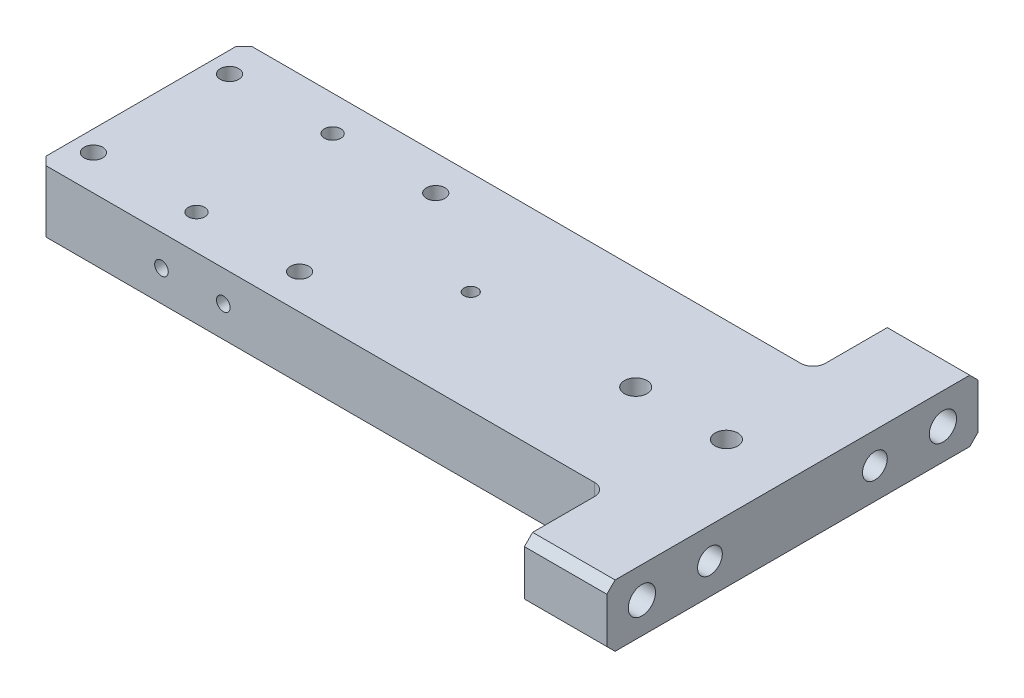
ISO-10303-21;
HEADER;
FILE_DESCRIPTION(('STEP AP214'),'2;1');
FILE_NAME('part.step','',(''),(''),'','','');
FILE_SCHEMA(('AUTOMOTIVE_DESIGN { 1 0 10303 214 1 1 1 1 }'));
ENDSEC;
DATA;
#1=APPLICATION_CONTEXT('core data for automotive mechanical design processes');
#2=APPLICATION_PROTOCOL_DEFINITION('international standard','automotive_design',2000,#1);
#3=PRODUCT_CONTEXT('',#1,'mechanical');
#4=PRODUCT('Part','Part','',(#3));
#5=PRODUCT_RELATED_PRODUCT_CATEGORY('part','',(#4));
#6=PRODUCT_DEFINITION_FORMATION('','',#4);
#7=PRODUCT_DEFINITION_CONTEXT('part definition',#1,'design');
#8=PRODUCT_DEFINITION('design','',#6,#7);
#9=PRODUCT_DEFINITION_SHAPE('','',#8);
#10=(LENGTH_UNIT() NAMED_UNIT(*) SI_UNIT(.MILLI.,.METRE.));
#11=(NAMED_UNIT(*) PLANE_ANGLE_UNIT() SI_UNIT($,.RADIAN.));
#12=(NAMED_UNIT(*) SI_UNIT($,.STERADIAN.) SOLID_ANGLE_UNIT());
#13=UNCERTAINTY_MEASURE_WITH_UNIT(LENGTH_MEASURE(1.E-05),#10,'distance_accuracy_value','');
#14=(GEOMETRIC_REPRESENTATION_CONTEXT(3) GLOBAL_UNCERTAINTY_ASSIGNED_CONTEXT((#13)) GLOBAL_UNIT_ASSIGNED_CONTEXT((#10,
#11,#12)) REPRESENTATION_CONTEXT('',''));
#15=CARTESIAN_POINT('',(0.,0.,0.));
#16=DIRECTION('',(0.,0.,1.));
#17=DIRECTION('',(1.,0.,0.));
#18=AXIS2_PLACEMENT_3D('',#15,#16,#17);
#19=CARTESIAN_POINT('',(79.,15.,-45.));
#20=DIRECTION('',(-1.,0.,0.));
#21=DIRECTION('',(0.,0.,1.));
#22=AXIS2_PLACEMENT_3D('',#19,#20,#21);
#23=PLANE('',#22);
#24=CARTESIAN_POINT('',(79.,7.5,20.));
#25=DIRECTION('',(1.,0.,0.));
#26=DIRECTION('',(0.,0.,-1.));
#27=AXIS2_PLACEMENT_3D('',#24,#25,#26);
#28=CIRCLE('',#27,3.);
#29=CARTESIAN_POINT('',(79.,7.5,17.));
#30=VERTEX_POINT('',#29);
#31=EDGE_CURVE('E249',#30,#30,#28,.T.);
#32=ORIENTED_EDGE('',*,*,#31,.F.);
#33=EDGE_LOOP('',(#32));
#34=FACE_BOUND('',#33,.T.);
#35=CARTESIAN_POINT('',(79.,7.5,-20.));
#36=DIRECTION('',(1.,0.,0.));
#37=DIRECTION('',(0.,0.,-1.));
#38=AXIS2_PLACEMENT_3D('',#35,#36,#37);
#39=CIRCLE('',#38,3.);
#40=CARTESIAN_POINT('',(79.,7.5,-23.));
#41=VERTEX_POINT('',#40);
#42=EDGE_CURVE('E255',#41,#41,#39,.T.);
#43=ORIENTED_EDGE('',*,*,#42,.F.);
#44=EDGE_LOOP('',(#43));
#45=FACE_BOUND('',#44,.T.);
#46=CARTESIAN_POINT('',(79.,7.5,36.5));
#47=DIRECTION('',(-1.,0.,0.));
#48=DIRECTION('',(0.,0.,1.));
#49=AXIS2_PLACEMENT_3D('',#46,#47,#48);
#50=CIRCLE('',#49,3.3);
#51=CARTESIAN_POINT('',(79.,7.5,39.8));
#52=VERTEX_POINT('',#51);
#53=EDGE_CURVE('E264',#52,#52,#50,.T.);
#54=ORIENTED_EDGE('',*,*,#53,.T.);
#55=EDGE_LOOP('',(#54));
#56=FACE_BOUND('',#55,.T.);
#57=CARTESIAN_POINT('',(79.,7.5,-36.5));
#58=DIRECTION('',(-1.,0.,0.));
#59=DIRECTION('',(0.,0.,1.));
#60=AXIS2_PLACEMENT_3D('',#57,#58,#59);
#61=CIRCLE('',#60,3.3);
#62=CARTESIAN_POINT('',(79.,7.5,-33.2000000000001));
#63=VERTEX_POINT('',#62);
#64=EDGE_CURVE('E270',#63,#63,#61,.T.);
#65=ORIENTED_EDGE('',*,*,#64,.T.);
#66=EDGE_LOOP('',(#65));
#67=FACE_BOUND('',#66,.T.);
#68=DIRECTION('',(0.,0.,-1.));
#69=VECTOR('',#68,1.);
#70=CARTESIAN_POINT('',(79.,0.,-45.));
#71=LINE('',#70,#69);
#72=CARTESIAN_POINT('',(79.,0.,43.));
#73=VERTEX_POINT('',#72);
#74=CARTESIAN_POINT('',(79.,0.,-43.));
#75=VERTEX_POINT('',#74);
#76=EDGE_CURVE('E360',#73,#75,#71,.T.);
#77=ORIENTED_EDGE('',*,*,#76,.T.);
#78=DIRECTION('',(0.,-0.707106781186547,0.707106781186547));
#79=VECTOR('',#78,1.);
#80=CARTESIAN_POINT('',(79.,2.00000000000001,-45.));
#81=LINE('',#80,#79);
#82=CARTESIAN_POINT('',(79.,2.,-45.));
#83=VERTEX_POINT('',#82);
#84=EDGE_CURVE('E447',#75,#83,#81,.F.);
#85=ORIENTED_EDGE('',*,*,#84,.T.);
#86=DIRECTION('',(0.,-1.,0.));
#87=VECTOR('',#86,1.);
#88=CARTESIAN_POINT('',(79.,15.,-45.));
#89=LINE('',#88,#87);
#90=CARTESIAN_POINT('',(79.,13.,-45.));
#91=VERTEX_POINT('',#90);
#92=EDGE_CURVE('E375',#91,#83,#89,.T.);
#93=ORIENTED_EDGE('',*,*,#92,.F.);
#94=DIRECTION('',(0.,0.707106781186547,0.707106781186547));
#95=VECTOR('',#94,1.);
#96=CARTESIAN_POINT('',(79.,15.,-43.));
#97=LINE('',#96,#95);
#98=CARTESIAN_POINT('',(79.,15.,-43.));
#99=VERTEX_POINT('',#98);
#100=EDGE_CURVE('E441',#91,#99,#97,.T.);
#101=ORIENTED_EDGE('',*,*,#100,.T.);
#102=DIRECTION('',(0.,0.,-1.));
#103=VECTOR('',#102,1.);
#104=CARTESIAN_POINT('',(79.,15.,-45.));
#105=LINE('',#104,#103);
#106=CARTESIAN_POINT('',(79.,15.,42.9999999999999));
#107=VERTEX_POINT('',#106);
#108=EDGE_CURVE('E361',#107,#99,#105,.T.);
#109=ORIENTED_EDGE('',*,*,#108,.F.);
#110=DIRECTION('',(0.,-0.707106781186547,0.707106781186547));
#111=VECTOR('',#110,1.);
#112=CARTESIAN_POINT('',(79.,15.,43.));
#113=LINE('',#112,#111);
#114=CARTESIAN_POINT('',(79.,13.,45.));
#115=VERTEX_POINT('',#114);
#116=EDGE_CURVE('E443',#107,#115,#113,.T.);
#117=ORIENTED_EDGE('',*,*,#116,.T.);
#118=DIRECTION('',(0.,-1.,0.));
#119=VECTOR('',#118,1.);
#120=CARTESIAN_POINT('',(79.,15.,45.));
#121=LINE('',#120,#119);
#122=CARTESIAN_POINT('',(79.,2.,45.));
#123=VERTEX_POINT('',#122);
#124=EDGE_CURVE('E368',#115,#123,#121,.T.);
#125=ORIENTED_EDGE('',*,*,#124,.T.);
#126=DIRECTION('',(0.,0.707106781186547,0.707106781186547));
#127=VECTOR('',#126,1.);
#128=CARTESIAN_POINT('',(79.,1.99999999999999,45.));
#129=LINE('',#128,#127);
#130=EDGE_CURVE('E445',#123,#73,#129,.F.);
#131=ORIENTED_EDGE('',*,*,#130,.T.);
#132=EDGE_LOOP('',(#77,#85,#93,#101,#109,#117,#125,#131));
#133=FACE_BOUND('',#132,.T.);
#134=ADVANCED_FACE('F41',(#34,#45,#56,#67,#133),#23,.F.);
#135=CARTESIAN_POINT('',(-79.,15.,-45.));
#136=DIRECTION('',(0.,0.,1.));
#137=DIRECTION('',(1.,0.,0.));
#138=AXIS2_PLACEMENT_3D('',#135,#136,#137);
#139=PLANE('',#138);
#140=ORIENTED_EDGE('',*,*,#92,.T.);
#141=DIRECTION('',(-1.,0.,0.));
#142=VECTOR('',#141,1.);
#143=CARTESIAN_POINT('',(-79.,2.,-45.));
#144=LINE('',#143,#142);
#145=CARTESIAN_POINT('',(59.,2.,-45.));
#146=VERTEX_POINT('',#145);
#147=EDGE_CURVE('E434',#83,#146,#144,.T.);
#148=ORIENTED_EDGE('',*,*,#147,.T.);
#149=DIRECTION('',(0.,1.,0.));
#150=VECTOR('',#149,1.);
#151=CARTESIAN_POINT('',(59.,15.,-45.));
#152=LINE('',#151,#150);
#153=CARTESIAN_POINT('',(59.,13.,-45.));
#154=VERTEX_POINT('',#153);
#155=EDGE_CURVE('E277',#146,#154,#152,.T.);
#156=ORIENTED_EDGE('',*,*,#155,.T.);
#157=DIRECTION('',(1.,0.,0.));
#158=VECTOR('',#157,1.);
#159=CARTESIAN_POINT('',(79.,13.,-45.));
#160=LINE('',#159,#158);
#161=EDGE_CURVE('E432',#154,#91,#160,.T.);
#162=ORIENTED_EDGE('',*,*,#161,.T.);
#163=EDGE_LOOP('',(#140,#148,#156,#162));
#164=FACE_BOUND('',#163,.T.);
#165=ADVANCED_FACE('F482',(#164),#139,.F.);
#166=CARTESIAN_POINT('',(-79.,15.,-45.));
#167=DIRECTION('',(1.,0.,0.));
#168=DIRECTION('',(0.,0.,-1.));
#169=AXIS2_PLACEMENT_3D('',#166,#167,#168);
#170=PLANE('',#169);
#171=DIRECTION('',(0.,0.,1.));
#172=VECTOR('',#171,1.);
#173=CARTESIAN_POINT('',(-79.,0.,-45.));
#174=LINE('',#173,#172);
#175=CARTESIAN_POINT('',(-79.,0.,-23.));
#176=VERTEX_POINT('',#175);
#177=CARTESIAN_POINT('',(-79.,0.,23.));
#178=VERTEX_POINT('',#177);
#179=EDGE_CURVE('E365',#176,#178,#174,.T.);
#180=ORIENTED_EDGE('',*,*,#179,.T.);
#181=DIRECTION('',(0.,1.,0.));
#182=VECTOR('',#181,1.);
#183=CARTESIAN_POINT('',(-79.,15.,23.));
#184=LINE('',#183,#182);
#185=CARTESIAN_POINT('',(-79.,15.,23.));
#186=VERTEX_POINT('',#185);
#187=EDGE_CURVE('E407',#178,#186,#184,.T.);
#188=ORIENTED_EDGE('',*,*,#187,.T.);
#189=DIRECTION('',(0.,0.,1.));
#190=VECTOR('',#189,1.);
#191=CARTESIAN_POINT('',(-79.,15.,-45.));
#192=LINE('',#191,#190);
#193=CARTESIAN_POINT('',(-79.,15.,-23.));
#194=VERTEX_POINT('',#193);
#195=EDGE_CURVE('E364',#194,#186,#192,.T.);
#196=ORIENTED_EDGE('',*,*,#195,.F.);
#197=DIRECTION('',(0.,-1.,0.));
#198=VECTOR('',#197,1.);
#199=CARTESIAN_POINT('',(-79.,15.,-23.));
#200=LINE('',#199,#198);
#201=EDGE_CURVE('E404',#194,#176,#200,.T.);
#202=ORIENTED_EDGE('',*,*,#201,.T.);
#203=EDGE_LOOP('',(#180,#188,#196,#202));
#204=FACE_BOUND('',#203,.T.);
#205=ADVANCED_FACE('F505',(#204),#170,.F.);
#206=CARTESIAN_POINT('',(-79.,15.,45.));
#207=DIRECTION('',(0.,0.,-1.));
#208=DIRECTION('',(-1.,0.,0.));
#209=AXIS2_PLACEMENT_3D('',#206,#207,#208);
#210=PLANE('',#209);
#211=DIRECTION('',(0.,-1.,0.));
#212=VECTOR('',#211,1.);
#213=CARTESIAN_POINT('',(59.,15.,45.));
#214=LINE('',#213,#212);
#215=CARTESIAN_POINT('',(59.,13.,45.));
#216=VERTEX_POINT('',#215);
#217=CARTESIAN_POINT('',(59.,2.,45.));
#218=VERTEX_POINT('',#217);
#219=EDGE_CURVE('E292',#216,#218,#214,.T.);
#220=ORIENTED_EDGE('',*,*,#219,.T.);
#221=DIRECTION('',(1.,0.,0.));
#222=VECTOR('',#221,1.);
#223=CARTESIAN_POINT('',(-79.,2.,45.));
#224=LINE('',#223,#222);
#225=EDGE_CURVE('E450',#218,#123,#224,.T.);
#226=ORIENTED_EDGE('',*,*,#225,.T.);
#227=ORIENTED_EDGE('',*,*,#124,.F.);
#228=DIRECTION('',(-1.,0.,0.));
#229=VECTOR('',#228,1.);
#230=CARTESIAN_POINT('',(59.,13.,45.));
#231=LINE('',#230,#229);
#232=EDGE_CURVE('E62',#115,#216,#231,.T.);
#233=ORIENTED_EDGE('',*,*,#232,.T.);
#234=EDGE_LOOP('',(#220,#226,#227,#233));
#235=FACE_BOUND('',#234,.T.);
#236=ADVANCED_FACE('F465',(#235),#210,.F.);
#237=CARTESIAN_POINT('',(0.,15.,0.));
#238=DIRECTION('',(0.,1.,0.));
#239=DIRECTION('',(0.,0.,1.));
#240=AXIS2_PLACEMENT_3D('',#237,#238,#239);
#241=PLANE('',#240);
#242=CARTESIAN_POINT('',(63.,15.,0.));
#243=DIRECTION('',(0.,-1.,0.));
#244=DIRECTION('',(0.,0.,-1.));
#245=AXIS2_PLACEMENT_3D('',#242,#243,#244);
#246=CIRCLE('',#245,2.75);
#247=CARTESIAN_POINT('',(63.,15.,-2.75));
#248=VERTEX_POINT('',#247);
#249=EDGE_CURVE('E216',#248,#248,#246,.T.);
#250=ORIENTED_EDGE('',*,*,#249,.T.);
#251=EDGE_LOOP('',(#250));
#252=FACE_BOUND('',#251,.T.);
#253=CARTESIAN_POINT('',(41.,15.,0.));
#254=DIRECTION('',(0.,-1.,0.));
#255=DIRECTION('',(0.,0.,-1.));
#256=AXIS2_PLACEMENT_3D('',#253,#254,#255);
#257=CIRCLE('',#256,2.75);
#258=CARTESIAN_POINT('',(41.,15.,-2.75));
#259=VERTEX_POINT('',#258);
#260=EDGE_CURVE('E228',#259,#259,#257,.T.);
#261=ORIENTED_EDGE('',*,*,#260,.T.);
#262=EDGE_LOOP('',(#261));
#263=FACE_BOUND('',#262,.T.);
#264=ORIENTED_EDGE('',*,*,#195,.T.);
#265=DIRECTION('',(-0.707106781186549,0.,-0.707106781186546));
#266=VECTOR('',#265,1.);
#267=CARTESIAN_POINT('',(-50.9999999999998,15.,51.));
#268=LINE('',#267,#266);
#269=CARTESIAN_POINT('',(-77.,15.,25.));
#270=VERTEX_POINT('',#269);
#271=EDGE_CURVE('E418',#186,#270,#268,.F.);
#272=ORIENTED_EDGE('',*,*,#271,.T.);
#273=DIRECTION('',(-1.,0.,0.));
#274=VECTOR('',#273,1.);
#275=CARTESIAN_POINT('',(-144.979037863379,15.,25.));
#276=LINE('',#275,#274);
#277=CARTESIAN_POINT('',(56.,15.,25.));
#278=VERTEX_POINT('',#277);
#279=EDGE_CURVE('E278',#278,#270,#276,.T.);
#280=ORIENTED_EDGE('',*,*,#279,.F.);
#281=CARTESIAN_POINT('',(56.,15.,28.));
#282=DIRECTION('',(0.,1.,0.));
#283=DIRECTION('',(0.,0.,1.));
#284=AXIS2_PLACEMENT_3D('',#281,#282,#283);
#285=CIRCLE('',#284,3.);
#286=CARTESIAN_POINT('',(59.,15.,28.));
#287=VERTEX_POINT('',#286);
#288=EDGE_CURVE('E399',#278,#287,#285,.F.);
#289=ORIENTED_EDGE('',*,*,#288,.T.);
#290=DIRECTION('',(0.,0.,-1.));
#291=VECTOR('',#290,1.);
#292=CARTESIAN_POINT('',(59.,15.,65.6184121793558));
#293=LINE('',#292,#291);
#294=CARTESIAN_POINT('',(59.,15.,43.));
#295=VERTEX_POINT('',#294);
#296=EDGE_CURVE('E279',#295,#287,#293,.T.);
#297=ORIENTED_EDGE('',*,*,#296,.F.);
#298=DIRECTION('',(1.,0.,0.));
#299=VECTOR('',#298,1.);
#300=CARTESIAN_POINT('',(79.,15.,43.));
#301=LINE('',#300,#299);
#302=EDGE_CURVE('E413',#295,#107,#301,.T.);
#303=ORIENTED_EDGE('',*,*,#302,.T.);
#304=ORIENTED_EDGE('',*,*,#108,.T.);
#305=DIRECTION('',(-1.,0.,0.));
#306=VECTOR('',#305,1.);
#307=CARTESIAN_POINT('',(59.,15.,-43.));
#308=LINE('',#307,#306);
#309=CARTESIAN_POINT('',(59.,15.,-43.));
#310=VERTEX_POINT('',#309);
#311=EDGE_CURVE('E410',#99,#310,#308,.T.);
#312=ORIENTED_EDGE('',*,*,#311,.T.);
#313=DIRECTION('',(0.,0.,-1.));
#314=VECTOR('',#313,1.);
#315=CARTESIAN_POINT('',(59.,15.,-88.7614918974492));
#316=LINE('',#315,#314);
#317=CARTESIAN_POINT('',(59.,15.,-28.));
#318=VERTEX_POINT('',#317);
#319=EDGE_CURVE('E286',#318,#310,#316,.T.);
#320=ORIENTED_EDGE('',*,*,#319,.F.);
#321=CARTESIAN_POINT('',(56.,15.,-28.));
#322=DIRECTION('',(0.,1.,0.));
#323=DIRECTION('',(0.,0.,1.));
#324=AXIS2_PLACEMENT_3D('',#321,#322,#323);
#325=CIRCLE('',#324,3.);
#326=CARTESIAN_POINT('',(56.,15.,-25.));
#327=VERTEX_POINT('',#326);
#328=EDGE_CURVE('E394',#318,#327,#325,.F.);
#329=ORIENTED_EDGE('',*,*,#328,.T.);
#330=DIRECTION('',(1.,0.,0.));
#331=VECTOR('',#330,1.);
#332=CARTESIAN_POINT('',(-144.979037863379,15.,-25.));
#333=LINE('',#332,#331);
#334=CARTESIAN_POINT('',(-77.,15.,-25.));
#335=VERTEX_POINT('',#334);
#336=EDGE_CURVE('E273',#335,#327,#333,.T.);
#337=ORIENTED_EDGE('',*,*,#336,.F.);
#338=DIRECTION('',(0.707106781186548,0.,-0.707106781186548));
#339=VECTOR('',#338,1.);
#340=CARTESIAN_POINT('',(-51.,15.,-51.));
#341=LINE('',#340,#339);
#342=EDGE_CURVE('E416',#335,#194,#341,.F.);
#343=ORIENTED_EDGE('',*,*,#342,.T.);
#344=EDGE_LOOP('',(#264,#272,#280,#289,#297,#303,#304,#312,#320,#329,#337,#343));
#345=FACE_BOUND('',#344,.T.);
#346=CARTESIAN_POINT('',(1.00000000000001,15.,0.));
#347=DIRECTION('',(0.,1.,0.));
#348=DIRECTION('',(0.,0.,1.));
#349=AXIS2_PLACEMENT_3D('',#346,#347,#348);
#350=CIRCLE('',#349,1.65);
#351=CARTESIAN_POINT('',(1.00000000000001,15.,1.65));
#352=VERTEX_POINT('',#351);
#353=EDGE_CURVE('E294',#352,#352,#350,.T.);
#354=ORIENTED_EDGE('',*,*,#353,.F.);
#355=EDGE_LOOP('',(#354));
#356=FACE_BOUND('',#355,.T.);
#357=CARTESIAN_POINT('',(-49.,15.,16.5));
#358=DIRECTION('',(0.,1.,0.));
#359=DIRECTION('',(0.,0.,1.));
#360=AXIS2_PLACEMENT_3D('',#357,#358,#359);
#361=CIRCLE('',#360,1.99999999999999);
#362=CARTESIAN_POINT('',(-49.,15.,18.5));
#363=VERTEX_POINT('',#362);
#364=EDGE_CURVE('E300',#363,#363,#361,.T.);
#365=ORIENTED_EDGE('',*,*,#364,.F.);
#366=EDGE_LOOP('',(#365));
#367=FACE_BOUND('',#366,.T.);
#368=CARTESIAN_POINT('',(-49.,15.,-16.5));
#369=DIRECTION('',(0.,1.,0.));
#370=DIRECTION('',(0.,0.,1.));
#371=AXIS2_PLACEMENT_3D('',#368,#369,#370);
#372=CIRCLE('',#371,1.99999999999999);
#373=CARTESIAN_POINT('',(-49.,15.,-14.5));
#374=VERTEX_POINT('',#373);
#375=EDGE_CURVE('E306',#374,#374,#372,.T.);
#376=ORIENTED_EDGE('',*,*,#375,.F.);
#377=EDGE_LOOP('',(#376));
#378=FACE_BOUND('',#377,.T.);
#379=CARTESIAN_POINT('',(-74.,15.,-16.5));
#380=DIRECTION('',(0.,-1.,0.));
#381=DIRECTION('',(0.,0.,-1.));
#382=AXIS2_PLACEMENT_3D('',#379,#380,#381);
#383=CIRCLE('',#382,2.25);
#384=CARTESIAN_POINT('',(-74.,15.,-18.75));
#385=VERTEX_POINT('',#384);
#386=EDGE_CURVE('E321',#385,#385,#383,.T.);
#387=ORIENTED_EDGE('',*,*,#386,.T.);
#388=EDGE_LOOP('',(#387));
#389=FACE_BOUND('',#388,.T.);
#390=CARTESIAN_POINT('',(-74.,15.,16.5));
#391=DIRECTION('',(0.,-1.,0.));
#392=DIRECTION('',(0.,0.,-1.));
#393=AXIS2_PLACEMENT_3D('',#390,#391,#392);
#394=CIRCLE('',#393,2.25);
#395=CARTESIAN_POINT('',(-74.,15.,14.25));
#396=VERTEX_POINT('',#395);
#397=EDGE_CURVE('E333',#396,#396,#394,.T.);
#398=ORIENTED_EDGE('',*,*,#397,.T.);
#399=EDGE_LOOP('',(#398));
#400=FACE_BOUND('',#399,.T.);
#401=CARTESIAN_POINT('',(-24.,15.,-16.5));
#402=DIRECTION('',(0.,-1.,0.));
#403=DIRECTION('',(0.,0.,-1.));
#404=AXIS2_PLACEMENT_3D('',#401,#402,#403);
#405=CIRCLE('',#404,2.25);
#406=CARTESIAN_POINT('',(-24.,15.,-18.75));
#407=VERTEX_POINT('',#406);
#408=EDGE_CURVE('E345',#407,#407,#405,.T.);
#409=ORIENTED_EDGE('',*,*,#408,.T.);
#410=EDGE_LOOP('',(#409));
#411=FACE_BOUND('',#410,.T.);
#412=CARTESIAN_POINT('',(-24.,15.,16.5));
#413=DIRECTION('',(0.,-1.,0.));
#414=DIRECTION('',(0.,0.,-1.));
#415=AXIS2_PLACEMENT_3D('',#412,#413,#414);
#416=CIRCLE('',#415,2.25);
#417=CARTESIAN_POINT('',(-24.,15.,14.25));
#418=VERTEX_POINT('',#417);
#419=EDGE_CURVE('E357',#418,#418,#416,.T.);
#420=ORIENTED_EDGE('',*,*,#419,.T.);
#421=EDGE_LOOP('',(#420));
#422=FACE_BOUND('',#421,.T.);
#423=ADVANCED_FACE('F458',(#252,#263,#345,#356,#367,#378,#389,#400,#411,#422),#241,.T.);
#424=CARTESIAN_POINT('',(0.,0.,0.));
#425=DIRECTION('',(0.,1.,0.));
#426=DIRECTION('',(0.,0.,1.));
#427=AXIS2_PLACEMENT_3D('',#424,#425,#426);
#428=PLANE('',#427);
#429=CARTESIAN_POINT('',(63.,0.,0.));
#430=DIRECTION('',(0.,-1.,0.));
#431=DIRECTION('',(0.,0.,-1.));
#432=AXIS2_PLACEMENT_3D('',#429,#430,#431);
#433=CIRCLE('',#432,4.99999999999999);
#434=CARTESIAN_POINT('',(63.,0.,-4.99999999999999));
#435=VERTEX_POINT('',#434);
#436=EDGE_CURVE('E207',#435,#435,#433,.T.);
#437=ORIENTED_EDGE('',*,*,#436,.F.);
#438=EDGE_LOOP('',(#437));
#439=FACE_BOUND('',#438,.T.);
#440=CARTESIAN_POINT('',(41.,0.,0.));
#441=DIRECTION('',(0.,-1.,0.));
#442=DIRECTION('',(0.,0.,-1.));
#443=AXIS2_PLACEMENT_3D('',#440,#441,#442);
#444=CIRCLE('',#443,4.99999999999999);
#445=CARTESIAN_POINT('',(41.,0.,-4.99999999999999));
#446=VERTEX_POINT('',#445);
#447=EDGE_CURVE('E219',#446,#446,#444,.T.);
#448=ORIENTED_EDGE('',*,*,#447,.F.);
#449=EDGE_LOOP('',(#448));
#450=FACE_BOUND('',#449,.T.);
#451=CARTESIAN_POINT('',(-30.,0.,-6.00000000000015));
#452=DIRECTION('',(0.,-1.,0.));
#453=DIRECTION('',(0.,0.,-1.));
#454=AXIS2_PLACEMENT_3D('',#451,#452,#453);
#455=CIRCLE('',#454,1.64999999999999);
#456=CARTESIAN_POINT('',(-30.,0.,-7.65000000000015));
#457=VERTEX_POINT('',#456);
#458=EDGE_CURVE('E237',#457,#457,#455,.T.);
#459=ORIENTED_EDGE('',*,*,#458,.F.);
#460=EDGE_LOOP('',(#459));
#461=FACE_BOUND('',#460,.T.);
#462=CARTESIAN_POINT('',(-45.,0.,-6.00000000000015));
#463=DIRECTION('',(0.,-1.,0.));
#464=DIRECTION('',(0.,0.,-1.));
#465=AXIS2_PLACEMENT_3D('',#462,#463,#464);
#466=CIRCLE('',#465,1.64999999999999);
#467=CARTESIAN_POINT('',(-45.,0.,-7.65000000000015));
#468=VERTEX_POINT('',#467);
#469=EDGE_CURVE('E243',#468,#468,#466,.T.);
#470=ORIENTED_EDGE('',*,*,#469,.F.);
#471=EDGE_LOOP('',(#470));
#472=FACE_BOUND('',#471,.T.);
#473=CARTESIAN_POINT('',(1.00000000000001,0.,0.));
#474=DIRECTION('',(0.,1.,0.));
#475=DIRECTION('',(0.,0.,1.));
#476=AXIS2_PLACEMENT_3D('',#473,#474,#475);
#477=CIRCLE('',#476,1.65);
#478=CARTESIAN_POINT('',(1.00000000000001,0.,1.65));
#479=VERTEX_POINT('',#478);
#480=EDGE_CURVE('E297',#479,#479,#477,.T.);
#481=ORIENTED_EDGE('',*,*,#480,.T.);
#482=EDGE_LOOP('',(#481));
#483=FACE_BOUND('',#482,.T.);
#484=CARTESIAN_POINT('',(-74.,0.,-16.5));
#485=DIRECTION('',(0.,-1.,0.));
#486=DIRECTION('',(0.,0.,-1.));
#487=AXIS2_PLACEMENT_3D('',#484,#485,#486);
#488=CIRCLE('',#487,4.);
#489=CARTESIAN_POINT('',(-74.,0.,-20.5));
#490=VERTEX_POINT('',#489);
#491=EDGE_CURVE('E312',#490,#490,#488,.T.);
#492=ORIENTED_EDGE('',*,*,#491,.F.);
#493=EDGE_LOOP('',(#492));
#494=FACE_BOUND('',#493,.T.);
#495=CARTESIAN_POINT('',(-74.,0.,16.5));
#496=DIRECTION('',(0.,-1.,0.));
#497=DIRECTION('',(0.,0.,-1.));
#498=AXIS2_PLACEMENT_3D('',#495,#496,#497);
#499=CIRCLE('',#498,4.);
#500=CARTESIAN_POINT('',(-74.,0.,12.5));
#501=VERTEX_POINT('',#500);
#502=EDGE_CURVE('E324',#501,#501,#499,.T.);
#503=ORIENTED_EDGE('',*,*,#502,.F.);
#504=EDGE_LOOP('',(#503));
#505=FACE_BOUND('',#504,.T.);
#506=CARTESIAN_POINT('',(-24.,0.,-16.5));
#507=DIRECTION('',(0.,-1.,0.));
#508=DIRECTION('',(0.,0.,-1.));
#509=AXIS2_PLACEMENT_3D('',#506,#507,#508);
#510=CIRCLE('',#509,4.);
#511=CARTESIAN_POINT('',(-24.,0.,-20.5));
#512=VERTEX_POINT('',#511);
#513=EDGE_CURVE('E336',#512,#512,#510,.T.);
#514=ORIENTED_EDGE('',*,*,#513,.F.);
#515=EDGE_LOOP('',(#514));
#516=FACE_BOUND('',#515,.T.);
#517=CARTESIAN_POINT('',(-24.,0.,16.5));
#518=DIRECTION('',(0.,-1.,0.));
#519=DIRECTION('',(0.,0.,-1.));
#520=AXIS2_PLACEMENT_3D('',#517,#518,#519);
#521=CIRCLE('',#520,4.);
#522=CARTESIAN_POINT('',(-24.,0.,12.5));
#523=VERTEX_POINT('',#522);
#524=EDGE_CURVE('E348',#523,#523,#521,.T.);
#525=ORIENTED_EDGE('',*,*,#524,.F.);
#526=EDGE_LOOP('',(#525));
#527=FACE_BOUND('',#526,.T.);
#528=DIRECTION('',(-1.,0.,0.));
#529=VECTOR('',#528,1.);
#530=CARTESIAN_POINT('',(-144.979037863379,0.,25.));
#531=LINE('',#530,#529);
#532=CARTESIAN_POINT('',(56.,0.,25.));
#533=VERTEX_POINT('',#532);
#534=CARTESIAN_POINT('',(-77.,0.,25.));
#535=VERTEX_POINT('',#534);
#536=EDGE_CURVE('E274',#533,#535,#531,.T.);
#537=ORIENTED_EDGE('',*,*,#536,.T.);
#538=DIRECTION('',(0.707106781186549,0.,0.707106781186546));
#539=VECTOR('',#538,1.);
#540=CARTESIAN_POINT('',(-79.,0.,23.));
#541=LINE('',#540,#539);
#542=EDGE_CURVE('E428',#535,#178,#541,.F.);
#543=ORIENTED_EDGE('',*,*,#542,.T.);
#544=ORIENTED_EDGE('',*,*,#179,.F.);
#545=DIRECTION('',(-0.707106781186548,0.,0.707106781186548));
#546=VECTOR('',#545,1.);
#547=CARTESIAN_POINT('',(-79.,0.,-23.));
#548=LINE('',#547,#546);
#549=CARTESIAN_POINT('',(-77.,0.,-25.));
#550=VERTEX_POINT('',#549);
#551=EDGE_CURVE('E426',#176,#550,#548,.F.);
#552=ORIENTED_EDGE('',*,*,#551,.T.);
#553=DIRECTION('',(1.,0.,0.));
#554=VECTOR('',#553,1.);
#555=CARTESIAN_POINT('',(0.,0.,-25.));
#556=LINE('',#555,#554);
#557=CARTESIAN_POINT('',(56.,0.,-25.));
#558=VERTEX_POINT('',#557);
#559=EDGE_CURVE('E378',#550,#558,#556,.T.);
#560=ORIENTED_EDGE('',*,*,#559,.T.);
#561=CARTESIAN_POINT('',(56.,0.,-28.));
#562=DIRECTION('',(0.,1.,0.));
#563=DIRECTION('',(0.,0.,1.));
#564=AXIS2_PLACEMENT_3D('',#561,#562,#563);
#565=CIRCLE('',#564,3.);
#566=CARTESIAN_POINT('',(59.,0.,-28.));
#567=VERTEX_POINT('',#566);
#568=EDGE_CURVE('E397',#558,#567,#565,.T.);
#569=ORIENTED_EDGE('',*,*,#568,.T.);
#570=DIRECTION('',(0.,0.,-1.));
#571=VECTOR('',#570,1.);
#572=CARTESIAN_POINT('',(59.,0.,-88.7614918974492));
#573=LINE('',#572,#571);
#574=CARTESIAN_POINT('',(59.,0.,-43.));
#575=VERTEX_POINT('',#574);
#576=EDGE_CURVE('E281',#567,#575,#573,.T.);
#577=ORIENTED_EDGE('',*,*,#576,.T.);
#578=DIRECTION('',(1.,0.,0.));
#579=VECTOR('',#578,1.);
#580=CARTESIAN_POINT('',(0.,0.,-43.));
#581=LINE('',#580,#579);
#582=EDGE_CURVE('E424',#575,#75,#581,.T.);
#583=ORIENTED_EDGE('',*,*,#582,.T.);
#584=ORIENTED_EDGE('',*,*,#76,.F.);
#585=DIRECTION('',(-1.,0.,0.));
#586=VECTOR('',#585,1.);
#587=CARTESIAN_POINT('',(0.,0.,43.));
#588=LINE('',#587,#586);
#589=CARTESIAN_POINT('',(59.,0.,43.));
#590=VERTEX_POINT('',#589);
#591=EDGE_CURVE('E422',#73,#590,#588,.T.);
#592=ORIENTED_EDGE('',*,*,#591,.T.);
#593=DIRECTION('',(0.,0.,-1.));
#594=VECTOR('',#593,1.);
#595=CARTESIAN_POINT('',(59.,0.,0.));
#596=LINE('',#595,#594);
#597=CARTESIAN_POINT('',(59.,0.,28.));
#598=VERTEX_POINT('',#597);
#599=EDGE_CURVE('E380',#590,#598,#596,.T.);
#600=ORIENTED_EDGE('',*,*,#599,.T.);
#601=CARTESIAN_POINT('',(56.,0.,28.));
#602=DIRECTION('',(0.,1.,0.));
#603=DIRECTION('',(0.,0.,1.));
#604=AXIS2_PLACEMENT_3D('',#601,#602,#603);
#605=CIRCLE('',#604,3.);
#606=EDGE_CURVE('E402',#598,#533,#605,.T.);
#607=ORIENTED_EDGE('',*,*,#606,.T.);
#608=EDGE_LOOP('',(#537,#543,#544,#552,#560,#569,#577,#583,#584,#592,#600,#607));
#609=FACE_BOUND('',#608,.T.);
#610=ADVANCED_FACE('F473',(#439,#450,#461,#472,#483,#494,#505,#516,#527,#609),#428,.F.);
#611=CARTESIAN_POINT('',(-24.,0.,16.5));
#612=DIRECTION('',(0.,-1.,0.));
#613=DIRECTION('',(0.,0.,-1.));
#614=AXIS2_PLACEMENT_3D('',#611,#612,#613);
#615=CYLINDRICAL_SURFACE('',#614,2.25);
#616=ORIENTED_EDGE('',*,*,#419,.F.);
#617=EDGE_LOOP('',(#616));
#618=FACE_BOUND('',#617,.T.);
#619=CARTESIAN_POINT('',(-24.,4.6,16.5));
#620=DIRECTION('',(0.,-1.,0.));
#621=DIRECTION('',(0.,0.,-1.));
#622=AXIS2_PLACEMENT_3D('',#619,#620,#621);
#623=CIRCLE('',#622,2.25);
#624=CARTESIAN_POINT('',(-24.,4.6,14.25));
#625=VERTEX_POINT('',#624);
#626=EDGE_CURVE('E354',#625,#625,#623,.T.);
#627=ORIENTED_EDGE('',*,*,#626,.T.);
#628=EDGE_LOOP('',(#627));
#629=FACE_BOUND('',#628,.T.);
#630=ADVANCED_FACE('F544',(#618,#629),#615,.F.);
#631=CARTESIAN_POINT('',(-21.75,4.6,16.5));
#632=DIRECTION('',(0.,1.,0.));
#633=DIRECTION('',(0.,0.,1.));
#634=AXIS2_PLACEMENT_3D('',#631,#632,#633);
#635=PLANE('',#634);
#636=ORIENTED_EDGE('',*,*,#626,.F.);
#637=EDGE_LOOP('',(#636));
#638=FACE_BOUND('',#637,.T.);
#639=CARTESIAN_POINT('',(-24.,4.6,16.5));
#640=DIRECTION('',(0.,-1.,0.));
#641=DIRECTION('',(0.,0.,-1.));
#642=AXIS2_PLACEMENT_3D('',#639,#640,#641);
#643=CIRCLE('',#642,4.);
#644=CARTESIAN_POINT('',(-24.,4.6,12.5));
#645=VERTEX_POINT('',#644);
#646=EDGE_CURVE('E351',#645,#645,#643,.T.);
#647=ORIENTED_EDGE('',*,*,#646,.T.);
#648=EDGE_LOOP('',(#647));
#649=FACE_BOUND('',#648,.T.);
#650=ADVANCED_FACE('F551',(#638,#649),#635,.F.);
#651=CARTESIAN_POINT('',(-24.,0.,16.5));
#652=DIRECTION('',(0.,-1.,0.));
#653=DIRECTION('',(0.,0.,-1.));
#654=AXIS2_PLACEMENT_3D('',#651,#652,#653);
#655=CYLINDRICAL_SURFACE('',#654,4.);
#656=ORIENTED_EDGE('',*,*,#646,.F.);
#657=EDGE_LOOP('',(#656));
#658=FACE_BOUND('',#657,.T.);
#659=ORIENTED_EDGE('',*,*,#524,.T.);
#660=EDGE_LOOP('',(#659));
#661=FACE_BOUND('',#660,.T.);
#662=ADVANCED_FACE('F555',(#658,#661),#655,.F.);
#663=CARTESIAN_POINT('',(-24.,0.,-16.5));
#664=DIRECTION('',(0.,-1.,0.));
#665=DIRECTION('',(0.,0.,-1.));
#666=AXIS2_PLACEMENT_3D('',#663,#664,#665);
#667=CYLINDRICAL_SURFACE('',#666,2.25);
#668=ORIENTED_EDGE('',*,*,#408,.F.);
#669=EDGE_LOOP('',(#668));
#670=FACE_BOUND('',#669,.T.);
#671=CARTESIAN_POINT('',(-24.,4.6,-16.5));
#672=DIRECTION('',(0.,-1.,0.));
#673=DIRECTION('',(0.,0.,-1.));
#674=AXIS2_PLACEMENT_3D('',#671,#672,#673);
#675=CIRCLE('',#674,2.25);
#676=CARTESIAN_POINT('',(-24.,4.6,-18.75));
#677=VERTEX_POINT('',#676);
#678=EDGE_CURVE('E342',#677,#677,#675,.T.);
#679=ORIENTED_EDGE('',*,*,#678,.T.);
#680=EDGE_LOOP('',(#679));
#681=FACE_BOUND('',#680,.T.);
#682=ADVANCED_FACE('F559',(#670,#681),#667,.F.);
#683=CARTESIAN_POINT('',(-21.75,4.6,-16.5));
#684=DIRECTION('',(0.,1.,0.));
#685=DIRECTION('',(0.,0.,1.));
#686=AXIS2_PLACEMENT_3D('',#683,#684,#685);
#687=PLANE('',#686);
#688=ORIENTED_EDGE('',*,*,#678,.F.);
#689=EDGE_LOOP('',(#688));
#690=FACE_BOUND('',#689,.T.);
#691=CARTESIAN_POINT('',(-24.,4.6,-16.5));
#692=DIRECTION('',(0.,-1.,0.));
#693=DIRECTION('',(0.,0.,-1.));
#694=AXIS2_PLACEMENT_3D('',#691,#692,#693);
#695=CIRCLE('',#694,4.);
#696=CARTESIAN_POINT('',(-24.,4.6,-20.5));
#697=VERTEX_POINT('',#696);
#698=EDGE_CURVE('E339',#697,#697,#695,.T.);
#699=ORIENTED_EDGE('',*,*,#698,.T.);
#700=EDGE_LOOP('',(#699));
#701=FACE_BOUND('',#700,.T.);
#702=ADVANCED_FACE('F563',(#690,#701),#687,.F.);
#703=CARTESIAN_POINT('',(-24.,0.,-16.5));
#704=DIRECTION('',(0.,-1.,0.));
#705=DIRECTION('',(0.,0.,-1.));
#706=AXIS2_PLACEMENT_3D('',#703,#704,#705);
#707=CYLINDRICAL_SURFACE('',#706,4.);
#708=ORIENTED_EDGE('',*,*,#698,.F.);
#709=EDGE_LOOP('',(#708));
#710=FACE_BOUND('',#709,.T.);
#711=ORIENTED_EDGE('',*,*,#513,.T.);
#712=EDGE_LOOP('',(#711));
#713=FACE_BOUND('',#712,.T.);
#714=ADVANCED_FACE('F567',(#710,#713),#707,.F.);
#715=CARTESIAN_POINT('',(-74.,0.,16.5));
#716=DIRECTION('',(0.,-1.,0.));
#717=DIRECTION('',(0.,0.,-1.));
#718=AXIS2_PLACEMENT_3D('',#715,#716,#717);
#719=CYLINDRICAL_SURFACE('',#718,2.25);
#720=ORIENTED_EDGE('',*,*,#397,.F.);
#721=EDGE_LOOP('',(#720));
#722=FACE_BOUND('',#721,.T.);
#723=CARTESIAN_POINT('',(-74.,4.6,16.5));
#724=DIRECTION('',(0.,-1.,0.));
#725=DIRECTION('',(0.,0.,-1.));
#726=AXIS2_PLACEMENT_3D('',#723,#724,#725);
#727=CIRCLE('',#726,2.25);
#728=CARTESIAN_POINT('',(-74.,4.6,14.25));
#729=VERTEX_POINT('',#728);
#730=EDGE_CURVE('E330',#729,#729,#727,.T.);
#731=ORIENTED_EDGE('',*,*,#730,.T.);
#732=EDGE_LOOP('',(#731));
#733=FACE_BOUND('',#732,.T.);
#734=ADVANCED_FACE('F571',(#722,#733),#719,.F.);
#735=CARTESIAN_POINT('',(-71.75,4.6,16.5));
#736=DIRECTION('',(0.,1.,0.));
#737=DIRECTION('',(0.,0.,1.));
#738=AXIS2_PLACEMENT_3D('',#735,#736,#737);
#739=PLANE('',#738);
#740=ORIENTED_EDGE('',*,*,#730,.F.);
#741=EDGE_LOOP('',(#740));
#742=FACE_BOUND('',#741,.T.);
#743=CARTESIAN_POINT('',(-74.,4.6,16.5));
#744=DIRECTION('',(0.,-1.,0.));
#745=DIRECTION('',(0.,0.,-1.));
#746=AXIS2_PLACEMENT_3D('',#743,#744,#745);
#747=CIRCLE('',#746,4.);
#748=CARTESIAN_POINT('',(-74.,4.6,12.5));
#749=VERTEX_POINT('',#748);
#750=EDGE_CURVE('E327',#749,#749,#747,.T.);
#751=ORIENTED_EDGE('',*,*,#750,.T.);
#752=EDGE_LOOP('',(#751));
#753=FACE_BOUND('',#752,.T.);
#754=ADVANCED_FACE('F575',(#742,#753),#739,.F.);
#755=CARTESIAN_POINT('',(-74.,0.,16.5));
#756=DIRECTION('',(0.,-1.,0.));
#757=DIRECTION('',(0.,0.,-1.));
#758=AXIS2_PLACEMENT_3D('',#755,#756,#757);
#759=CYLINDRICAL_SURFACE('',#758,4.);
#760=ORIENTED_EDGE('',*,*,#750,.F.);
#761=EDGE_LOOP('',(#760));
#762=FACE_BOUND('',#761,.T.);
#763=ORIENTED_EDGE('',*,*,#502,.T.);
#764=EDGE_LOOP('',(#763));
#765=FACE_BOUND('',#764,.T.);
#766=ADVANCED_FACE('F579',(#762,#765),#759,.F.);
#767=CARTESIAN_POINT('',(-74.,0.,-16.5));
#768=DIRECTION('',(0.,-1.,0.));
#769=DIRECTION('',(0.,0.,-1.));
#770=AXIS2_PLACEMENT_3D('',#767,#768,#769);
#771=CYLINDRICAL_SURFACE('',#770,2.25);
#772=ORIENTED_EDGE('',*,*,#386,.F.);
#773=EDGE_LOOP('',(#772));
#774=FACE_BOUND('',#773,.T.);
#775=CARTESIAN_POINT('',(-74.,4.6,-16.5));
#776=DIRECTION('',(0.,-1.,0.));
#777=DIRECTION('',(0.,0.,-1.));
#778=AXIS2_PLACEMENT_3D('',#775,#776,#777);
#779=CIRCLE('',#778,2.25);
#780=CARTESIAN_POINT('',(-74.,4.6,-18.75));
#781=VERTEX_POINT('',#780);
#782=EDGE_CURVE('E318',#781,#781,#779,.T.);
#783=ORIENTED_EDGE('',*,*,#782,.T.);
#784=EDGE_LOOP('',(#783));
#785=FACE_BOUND('',#784,.T.);
#786=ADVANCED_FACE('F583',(#774,#785),#771,.F.);
#787=CARTESIAN_POINT('',(-71.75,4.6,-16.5));
#788=DIRECTION('',(0.,1.,0.));
#789=DIRECTION('',(0.,0.,1.));
#790=AXIS2_PLACEMENT_3D('',#787,#788,#789);
#791=PLANE('',#790);
#792=ORIENTED_EDGE('',*,*,#782,.F.);
#793=EDGE_LOOP('',(#792));
#794=FACE_BOUND('',#793,.T.);
#795=CARTESIAN_POINT('',(-74.,4.6,-16.5));
#796=DIRECTION('',(0.,-1.,0.));
#797=DIRECTION('',(0.,0.,-1.));
#798=AXIS2_PLACEMENT_3D('',#795,#796,#797);
#799=CIRCLE('',#798,4.);
#800=CARTESIAN_POINT('',(-74.,4.6,-20.5));
#801=VERTEX_POINT('',#800);
#802=EDGE_CURVE('E315',#801,#801,#799,.T.);
#803=ORIENTED_EDGE('',*,*,#802,.T.);
#804=EDGE_LOOP('',(#803));
#805=FACE_BOUND('',#804,.T.);
#806=ADVANCED_FACE('F587',(#794,#805),#791,.F.);
#807=CARTESIAN_POINT('',(-74.,0.,-16.5));
#808=DIRECTION('',(0.,-1.,0.));
#809=DIRECTION('',(0.,0.,-1.));
#810=AXIS2_PLACEMENT_3D('',#807,#808,#809);
#811=CYLINDRICAL_SURFACE('',#810,4.);
#812=ORIENTED_EDGE('',*,*,#802,.F.);
#813=EDGE_LOOP('',(#812));
#814=FACE_BOUND('',#813,.T.);
#815=ORIENTED_EDGE('',*,*,#491,.T.);
#816=EDGE_LOOP('',(#815));
#817=FACE_BOUND('',#816,.T.);
#818=ADVANCED_FACE('F591',(#814,#817),#811,.F.);
#819=CARTESIAN_POINT('',(-49.,10.,-16.5));
#820=DIRECTION('',(0.,-1.,0.));
#821=DIRECTION('',(0.,0.,-1.));
#822=AXIS2_PLACEMENT_3D('',#819,#820,#821);
#823=PLANE('',#822);
#824=CARTESIAN_POINT('',(-49.,10.,-16.5));
#825=DIRECTION('',(0.,1.,0.));
#826=DIRECTION('',(0.,0.,1.));
#827=AXIS2_PLACEMENT_3D('',#824,#825,#826);
#828=CIRCLE('',#827,1.99999999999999);
#829=CARTESIAN_POINT('',(-49.,10.,-14.5));
#830=VERTEX_POINT('',#829);
#831=EDGE_CURVE('E309',#830,#830,#828,.T.);
#832=ORIENTED_EDGE('',*,*,#831,.T.);
#833=EDGE_LOOP('',(#832));
#834=FACE_BOUND('',#833,.T.);
#835=ADVANCED_FACE('F595',(#834),#823,.F.);
#836=CARTESIAN_POINT('',(-49.,15.,-16.5));
#837=DIRECTION('',(0.,1.,0.));
#838=DIRECTION('',(0.,0.,1.));
#839=AXIS2_PLACEMENT_3D('',#836,#837,#838);
#840=CYLINDRICAL_SURFACE('',#839,1.99999999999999);
#841=ORIENTED_EDGE('',*,*,#831,.F.);
#842=EDGE_LOOP('',(#841));
#843=FACE_BOUND('',#842,.T.);
#844=ORIENTED_EDGE('',*,*,#375,.T.);
#845=EDGE_LOOP('',(#844));
#846=FACE_BOUND('',#845,.T.);
#847=ADVANCED_FACE('F599',(#843,#846),#840,.F.);
#848=CARTESIAN_POINT('',(-49.,10.,16.5));
#849=DIRECTION('',(0.,-1.,0.));
#850=DIRECTION('',(0.,0.,-1.));
#851=AXIS2_PLACEMENT_3D('',#848,#849,#850);
#852=PLANE('',#851);
#853=CARTESIAN_POINT('',(-49.,10.,16.5));
#854=DIRECTION('',(0.,1.,0.));
#855=DIRECTION('',(0.,0.,1.));
#856=AXIS2_PLACEMENT_3D('',#853,#854,#855);
#857=CIRCLE('',#856,1.99999999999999);
#858=CARTESIAN_POINT('',(-49.,10.,18.5));
#859=VERTEX_POINT('',#858);
#860=EDGE_CURVE('E303',#859,#859,#857,.T.);
#861=ORIENTED_EDGE('',*,*,#860,.T.);
#862=EDGE_LOOP('',(#861));
#863=FACE_BOUND('',#862,.T.);
#864=ADVANCED_FACE('F603',(#863),#852,.F.);
#865=CARTESIAN_POINT('',(-49.,15.,16.5));
#866=DIRECTION('',(0.,1.,0.));
#867=DIRECTION('',(0.,0.,1.));
#868=AXIS2_PLACEMENT_3D('',#865,#866,#867);
#869=CYLINDRICAL_SURFACE('',#868,1.99999999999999);
#870=ORIENTED_EDGE('',*,*,#860,.F.);
#871=EDGE_LOOP('',(#870));
#872=FACE_BOUND('',#871,.T.);
#873=ORIENTED_EDGE('',*,*,#364,.T.);
#874=EDGE_LOOP('',(#873));
#875=FACE_BOUND('',#874,.T.);
#876=ADVANCED_FACE('F607',(#872,#875),#869,.F.);
#877=CARTESIAN_POINT('',(1.00000000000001,15.,0.));
#878=DIRECTION('',(0.,1.,0.));
#879=DIRECTION('',(0.,0.,1.));
#880=AXIS2_PLACEMENT_3D('',#877,#878,#879);
#881=CYLINDRICAL_SURFACE('',#880,1.65);
#882=ORIENTED_EDGE('',*,*,#480,.F.);
#883=EDGE_LOOP('',(#882));
#884=FACE_BOUND('',#883,.T.);
#885=ORIENTED_EDGE('',*,*,#353,.T.);
#886=EDGE_LOOP('',(#885));
#887=FACE_BOUND('',#886,.T.);
#888=ADVANCED_FACE('F611',(#884,#887),#881,.F.);
#889=CARTESIAN_POINT('',(59.,0.,-88.7614918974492));
#890=DIRECTION('',(1.,0.,0.));
#891=DIRECTION('',(0.,0.,-1.));
#892=AXIS2_PLACEMENT_3D('',#889,#890,#891);
#893=PLANE('',#892);
#894=CARTESIAN_POINT('',(59.,7.5,-36.5));
#895=DIRECTION('',(-1.,0.,0.));
#896=DIRECTION('',(0.,0.,1.));
#897=AXIS2_PLACEMENT_3D('',#894,#895,#896);
#898=CIRCLE('',#897,3.29999999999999);
#899=CARTESIAN_POINT('',(59.,7.5,-33.2000000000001));
#900=VERTEX_POINT('',#899);
#901=EDGE_CURVE('E267',#900,#900,#898,.T.);
#902=ORIENTED_EDGE('',*,*,#901,.F.);
#903=EDGE_LOOP('',(#902));
#904=FACE_BOUND('',#903,.T.);
#905=ORIENTED_EDGE('',*,*,#155,.F.);
#906=DIRECTION('',(0.,0.707106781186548,-0.707106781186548));
#907=VECTOR('',#906,1.);
#908=CARTESIAN_POINT('',(59.,2.00000000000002,-45.));
#909=LINE('',#908,#907);
#910=EDGE_CURVE('E439',#146,#575,#909,.F.);
#911=ORIENTED_EDGE('',*,*,#910,.T.);
#912=ORIENTED_EDGE('',*,*,#576,.F.);
#913=DIRECTION('',(0.,1.,0.));
#914=VECTOR('',#913,1.);
#915=CARTESIAN_POINT('',(59.,15.,-28.));
#916=LINE('',#915,#914);
#917=EDGE_CURVE('E382',#567,#318,#916,.T.);
#918=ORIENTED_EDGE('',*,*,#917,.T.);
#919=ORIENTED_EDGE('',*,*,#319,.T.);
#920=DIRECTION('',(0.,-0.707106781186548,-0.707106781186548));
#921=VECTOR('',#920,1.);
#922=CARTESIAN_POINT('',(59.,15.,-43.));
#923=LINE('',#922,#921);
#924=EDGE_CURVE('E437',#310,#154,#923,.T.);
#925=ORIENTED_EDGE('',*,*,#924,.T.);
#926=EDGE_LOOP('',(#905,#911,#912,#918,#919,#925));
#927=FACE_BOUND('',#926,.T.);
#928=ADVANCED_FACE('F489',(#904,#927),#893,.F.);
#929=CARTESIAN_POINT('',(-144.979037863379,0.,-25.));
#930=DIRECTION('',(0.,0.,1.));
#931=DIRECTION('',(1.,0.,0.));
#932=AXIS2_PLACEMENT_3D('',#929,#930,#931);
#933=PLANE('',#932);
#934=CARTESIAN_POINT('',(-49.,7.5,-25.));
#935=DIRECTION('',(0.,0.,-1.));
#936=DIRECTION('',(-1.,0.,0.));
#937=AXIS2_PLACEMENT_3D('',#934,#935,#936);
#938=CIRCLE('',#937,1.64999999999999);
#939=CARTESIAN_POINT('',(-50.65,7.5,-25.));
#940=VERTEX_POINT('',#939);
#941=EDGE_CURVE('E185',#940,#940,#938,.T.);
#942=ORIENTED_EDGE('',*,*,#941,.F.);
#943=EDGE_LOOP('',(#942));
#944=FACE_BOUND('',#943,.T.);
#945=CARTESIAN_POINT('',(-34.,7.5,-25.));
#946=DIRECTION('',(0.,0.,-1.));
#947=DIRECTION('',(-1.,0.,0.));
#948=AXIS2_PLACEMENT_3D('',#945,#946,#947);
#949=CIRCLE('',#948,1.64999999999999);
#950=CARTESIAN_POINT('',(-35.65,7.5,-25.));
#951=VERTEX_POINT('',#950);
#952=EDGE_CURVE('E184',#951,#951,#949,.T.);
#953=ORIENTED_EDGE('',*,*,#952,.F.);
#954=EDGE_LOOP('',(#953));
#955=FACE_BOUND('',#954,.T.);
#956=CARTESIAN_POINT('',(-3.99999999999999,7.5,-25.));
#957=DIRECTION('',(0.,0.,-1.));
#958=DIRECTION('',(-1.,0.,0.));
#959=AXIS2_PLACEMENT_3D('',#956,#957,#958);
#960=CIRCLE('',#959,1.64999999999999);
#961=CARTESIAN_POINT('',(-5.64999999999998,7.5,-25.));
#962=VERTEX_POINT('',#961);
#963=EDGE_CURVE('E231',#962,#962,#960,.T.);
#964=ORIENTED_EDGE('',*,*,#963,.F.);
#965=EDGE_LOOP('',(#964));
#966=FACE_BOUND('',#965,.T.);
#967=ORIENTED_EDGE('',*,*,#559,.F.);
#968=DIRECTION('',(0.,1.,0.));
#969=VECTOR('',#968,1.);
#970=CARTESIAN_POINT('',(-77.,0.,-25.));
#971=LINE('',#970,#969);
#972=EDGE_CURVE('E430',#550,#335,#971,.T.);
#973=ORIENTED_EDGE('',*,*,#972,.T.);
#974=ORIENTED_EDGE('',*,*,#336,.T.);
#975=DIRECTION('',(0.,1.,0.));
#976=VECTOR('',#975,1.);
#977=CARTESIAN_POINT('',(56.,0.,-25.));
#978=LINE('',#977,#976);
#979=EDGE_CURVE('E385',#327,#558,#978,.F.);
#980=ORIENTED_EDGE('',*,*,#979,.T.);
#981=EDGE_LOOP('',(#967,#973,#974,#980));
#982=FACE_BOUND('',#981,.T.);
#983=ADVANCED_FACE('F616',(#944,#955,#966,#982),#933,.F.);
#984=CARTESIAN_POINT('',(-144.979037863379,0.,25.));
#985=DIRECTION('',(0.,0.,-1.));
#986=DIRECTION('',(-1.,0.,0.));
#987=AXIS2_PLACEMENT_3D('',#984,#985,#986);
#988=PLANE('',#987);
#989=CARTESIAN_POINT('',(-49.,7.5,25.));
#990=DIRECTION('',(0.,0.,1.));
#991=DIRECTION('',(1.,0.,0.));
#992=AXIS2_PLACEMENT_3D('',#989,#990,#991);
#993=CIRCLE('',#992,1.64999999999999);
#994=CARTESIAN_POINT('',(-47.35,7.5,25.));
#995=VERTEX_POINT('',#994);
#996=EDGE_CURVE('E195',#995,#995,#993,.T.);
#997=ORIENTED_EDGE('',*,*,#996,.F.);
#998=EDGE_LOOP('',(#997));
#999=FACE_BOUND('',#998,.T.);
#1000=CARTESIAN_POINT('',(-34.,7.5,25.));
#1001=DIRECTION('',(0.,0.,1.));
#1002=DIRECTION('',(1.,0.,0.));
#1003=AXIS2_PLACEMENT_3D('',#1000,#1001,#1002);
#1004=CIRCLE('',#1003,1.64999999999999);
#1005=CARTESIAN_POINT('',(-32.35,7.5,25.));
#1006=VERTEX_POINT('',#1005);
#1007=EDGE_CURVE('E201',#1006,#1006,#1004,.T.);
#1008=ORIENTED_EDGE('',*,*,#1007,.F.);
#1009=EDGE_LOOP('',(#1008));
#1010=FACE_BOUND('',#1009,.T.);
#1011=ORIENTED_EDGE('',*,*,#279,.T.);
#1012=DIRECTION('',(0.,-1.,0.));
#1013=VECTOR('',#1012,1.);
#1014=CARTESIAN_POINT('',(-77.,0.,25.));
#1015=LINE('',#1014,#1013);
#1016=EDGE_CURVE('E420',#270,#535,#1015,.T.);
#1017=ORIENTED_EDGE('',*,*,#1016,.T.);
#1018=ORIENTED_EDGE('',*,*,#536,.F.);
#1019=DIRECTION('',(0.,1.,0.));
#1020=VECTOR('',#1019,1.);
#1021=CARTESIAN_POINT('',(56.,15.,25.));
#1022=LINE('',#1021,#1020);
#1023=EDGE_CURVE('E388',#533,#278,#1022,.T.);
#1024=ORIENTED_EDGE('',*,*,#1023,.T.);
#1025=EDGE_LOOP('',(#1011,#1017,#1018,#1024));
#1026=FACE_BOUND('',#1025,.T.);
#1027=ADVANCED_FACE('F514',(#999,#1010,#1026),#988,.F.);
#1028=CARTESIAN_POINT('',(59.,0.,65.6184121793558));
#1029=DIRECTION('',(1.,0.,0.));
#1030=DIRECTION('',(0.,0.,-1.));
#1031=AXIS2_PLACEMENT_3D('',#1028,#1029,#1030);
#1032=PLANE('',#1031);
#1033=CARTESIAN_POINT('',(59.,7.5,36.5));
#1034=DIRECTION('',(-1.,0.,0.));
#1035=DIRECTION('',(0.,0.,1.));
#1036=AXIS2_PLACEMENT_3D('',#1033,#1034,#1035);
#1037=CIRCLE('',#1036,3.29999999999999);
#1038=CARTESIAN_POINT('',(59.,7.5,39.8));
#1039=VERTEX_POINT('',#1038);
#1040=EDGE_CURVE('E261',#1039,#1039,#1037,.T.);
#1041=ORIENTED_EDGE('',*,*,#1040,.F.);
#1042=EDGE_LOOP('',(#1041));
#1043=FACE_BOUND('',#1042,.T.);
#1044=ORIENTED_EDGE('',*,*,#599,.F.);
#1045=DIRECTION('',(0.,-0.707106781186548,-0.707106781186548));
#1046=VECTOR('',#1045,1.);
#1047=CARTESIAN_POINT('',(59.,1.99999999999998,45.));
#1048=LINE('',#1047,#1046);
#1049=EDGE_CURVE('E11',#590,#218,#1048,.F.);
#1050=ORIENTED_EDGE('',*,*,#1049,.T.);
#1051=ORIENTED_EDGE('',*,*,#219,.F.);
#1052=DIRECTION('',(0.,0.707106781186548,-0.707106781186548));
#1053=VECTOR('',#1052,1.);
#1054=CARTESIAN_POINT('',(59.,15.,43.));
#1055=LINE('',#1054,#1053);
#1056=EDGE_CURVE('E50',#216,#295,#1055,.T.);
#1057=ORIENTED_EDGE('',*,*,#1056,.T.);
#1058=ORIENTED_EDGE('',*,*,#296,.T.);
#1059=DIRECTION('',(0.,1.,0.));
#1060=VECTOR('',#1059,1.);
#1061=CARTESIAN_POINT('',(59.,0.,28.));
#1062=LINE('',#1061,#1060);
#1063=EDGE_CURVE('E391',#287,#598,#1062,.F.);
#1064=ORIENTED_EDGE('',*,*,#1063,.T.);
#1065=EDGE_LOOP('',(#1044,#1050,#1051,#1057,#1058,#1064));
#1066=FACE_BOUND('',#1065,.T.);
#1067=ADVANCED_FACE('F454',(#1043,#1066),#1032,.F.);
#1068=CARTESIAN_POINT('',(59.,7.5,-36.5));
#1069=DIRECTION('',(-1.,0.,0.));
#1070=DIRECTION('',(0.,0.,1.));
#1071=AXIS2_PLACEMENT_3D('',#1068,#1069,#1070);
#1072=CYLINDRICAL_SURFACE('',#1071,3.29999999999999);
#1073=ORIENTED_EDGE('',*,*,#64,.F.);
#1074=EDGE_LOOP('',(#1073));
#1075=FACE_BOUND('',#1074,.T.);
#1076=ORIENTED_EDGE('',*,*,#901,.T.);
#1077=EDGE_LOOP('',(#1076));
#1078=FACE_BOUND('',#1077,.T.);
#1079=ADVANCED_FACE('F625',(#1075,#1078),#1072,.F.);
#1080=CARTESIAN_POINT('',(59.,7.5,36.5));
#1081=DIRECTION('',(-1.,0.,0.));
#1082=DIRECTION('',(0.,0.,1.));
#1083=AXIS2_PLACEMENT_3D('',#1080,#1081,#1082);
#1084=CYLINDRICAL_SURFACE('',#1083,3.29999999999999);
#1085=ORIENTED_EDGE('',*,*,#53,.F.);
#1086=EDGE_LOOP('',(#1085));
#1087=FACE_BOUND('',#1086,.T.);
#1088=ORIENTED_EDGE('',*,*,#1040,.T.);
#1089=EDGE_LOOP('',(#1088));
#1090=FACE_BOUND('',#1089,.T.);
#1091=ADVANCED_FACE('F632',(#1087,#1090),#1084,.F.);
#1092=CARTESIAN_POINT('',(74.,7.5,-20.));
#1093=DIRECTION('',(-1.,0.,0.));
#1094=DIRECTION('',(0.,0.,1.));
#1095=AXIS2_PLACEMENT_3D('',#1092,#1093,#1094);
#1096=PLANE('',#1095);
#1097=CARTESIAN_POINT('',(74.,7.5,-20.));
#1098=DIRECTION('',(1.,0.,0.));
#1099=DIRECTION('',(0.,0.,-1.));
#1100=AXIS2_PLACEMENT_3D('',#1097,#1098,#1099);
#1101=CIRCLE('',#1100,3.);
#1102=CARTESIAN_POINT('',(74.,7.5,-23.));
#1103=VERTEX_POINT('',#1102);
#1104=EDGE_CURVE('E258',#1103,#1103,#1101,.T.);
#1105=ORIENTED_EDGE('',*,*,#1104,.T.);
#1106=EDGE_LOOP('',(#1105));
#1107=FACE_BOUND('',#1106,.T.);
#1108=ADVANCED_FACE('F636',(#1107),#1096,.F.);
#1109=CARTESIAN_POINT('',(79.,7.5,-20.));
#1110=DIRECTION('',(1.,0.,0.));
#1111=DIRECTION('',(0.,0.,-1.));
#1112=AXIS2_PLACEMENT_3D('',#1109,#1110,#1111);
#1113=CYLINDRICAL_SURFACE('',#1112,3.);
#1114=ORIENTED_EDGE('',*,*,#1104,.F.);
#1115=EDGE_LOOP('',(#1114));
#1116=FACE_BOUND('',#1115,.T.);
#1117=ORIENTED_EDGE('',*,*,#42,.T.);
#1118=EDGE_LOOP('',(#1117));
#1119=FACE_BOUND('',#1118,.T.);
#1120=ADVANCED_FACE('F640',(#1116,#1119),#1113,.F.);
#1121=CARTESIAN_POINT('',(74.,7.5,20.));
#1122=DIRECTION('',(-1.,0.,0.));
#1123=DIRECTION('',(0.,0.,1.));
#1124=AXIS2_PLACEMENT_3D('',#1121,#1122,#1123);
#1125=PLANE('',#1124);
#1126=CARTESIAN_POINT('',(74.,7.5,20.));
#1127=DIRECTION('',(1.,0.,0.));
#1128=DIRECTION('',(0.,0.,-1.));
#1129=AXIS2_PLACEMENT_3D('',#1126,#1127,#1128);
#1130=CIRCLE('',#1129,3.);
#1131=CARTESIAN_POINT('',(74.,7.5,17.));
#1132=VERTEX_POINT('',#1131);
#1133=EDGE_CURVE('E252',#1132,#1132,#1130,.T.);
#1134=ORIENTED_EDGE('',*,*,#1133,.T.);
#1135=EDGE_LOOP('',(#1134));
#1136=FACE_BOUND('',#1135,.T.);
#1137=ADVANCED_FACE('F644',(#1136),#1125,.F.);
#1138=CARTESIAN_POINT('',(79.,7.5,20.));
#1139=DIRECTION('',(1.,0.,0.));
#1140=DIRECTION('',(0.,0.,-1.));
#1141=AXIS2_PLACEMENT_3D('',#1138,#1139,#1140);
#1142=CYLINDRICAL_SURFACE('',#1141,3.);
#1143=ORIENTED_EDGE('',*,*,#1133,.F.);
#1144=EDGE_LOOP('',(#1143));
#1145=FACE_BOUND('',#1144,.T.);
#1146=ORIENTED_EDGE('',*,*,#31,.T.);
#1147=EDGE_LOOP('',(#1146));
#1148=FACE_BOUND('',#1147,.T.);
#1149=ADVANCED_FACE('F648',(#1145,#1148),#1142,.F.);
#1150=CARTESIAN_POINT('',(-45.,7.99999999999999,-6.00000000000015));
#1151=DIRECTION('',(0.,-1.,0.));
#1152=DIRECTION('',(0.,0.,-1.));
#1153=AXIS2_PLACEMENT_3D('',#1150,#1151,#1152);
#1154=CONICAL_SURFACE('',#1153,1.64999999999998,1.02974425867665);
#1155=CARTESIAN_POINT('',(-45.,8.99142002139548,-6.00000000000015));
#1156=VERTEX_POINT('',#1155);
#1157=VERTEX_LOOP('',#1156);
#1158=FACE_BOUND('',#1157,.T.);
#1159=CARTESIAN_POINT('',(-45.,7.99999999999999,-6.00000000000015));
#1160=DIRECTION('',(0.,-1.,0.));
#1161=DIRECTION('',(0.,0.,-1.));
#1162=AXIS2_PLACEMENT_3D('',#1159,#1160,#1161);
#1163=CIRCLE('',#1162,1.64999999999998);
#1164=CARTESIAN_POINT('',(-45.,7.99999999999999,-7.65000000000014));
#1165=VERTEX_POINT('',#1164);
#1166=EDGE_CURVE('E246',#1165,#1165,#1163,.T.);
#1167=ORIENTED_EDGE('',*,*,#1166,.T.);
#1168=EDGE_LOOP('',(#1167));
#1169=FACE_BOUND('',#1168,.T.);
#1170=ADVANCED_FACE('F652',(#1158,#1169),#1154,.F.);
#1171=CARTESIAN_POINT('',(-45.,0.,-6.00000000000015));
#1172=DIRECTION('',(0.,-1.,0.));
#1173=DIRECTION('',(0.,0.,-1.));
#1174=AXIS2_PLACEMENT_3D('',#1171,#1172,#1173);
#1175=CYLINDRICAL_SURFACE('',#1174,1.64999999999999);
#1176=ORIENTED_EDGE('',*,*,#1166,.F.);
#1177=EDGE_LOOP('',(#1176));
#1178=FACE_BOUND('',#1177,.T.);
#1179=ORIENTED_EDGE('',*,*,#469,.T.);
#1180=EDGE_LOOP('',(#1179));
#1181=FACE_BOUND('',#1180,.T.);
#1182=ADVANCED_FACE('F656',(#1178,#1181),#1175,.F.);
#1183=CARTESIAN_POINT('',(-30.,7.99999999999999,-6.00000000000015));
#1184=DIRECTION('',(0.,-1.,0.));
#1185=DIRECTION('',(0.,0.,-1.));
#1186=AXIS2_PLACEMENT_3D('',#1183,#1184,#1185);
#1187=CONICAL_SURFACE('',#1186,1.64999999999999,1.02974425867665);
#1188=CARTESIAN_POINT('',(-30.,8.99142002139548,-6.00000000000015));
#1189=VERTEX_POINT('',#1188);
#1190=VERTEX_LOOP('',#1189);
#1191=FACE_BOUND('',#1190,.T.);
#1192=CARTESIAN_POINT('',(-30.,7.99999999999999,-6.00000000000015));
#1193=DIRECTION('',(0.,-1.,0.));
#1194=DIRECTION('',(0.,0.,-1.));
#1195=AXIS2_PLACEMENT_3D('',#1192,#1193,#1194);
#1196=CIRCLE('',#1195,1.64999999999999);
#1197=CARTESIAN_POINT('',(-30.,7.99999999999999,-7.65000000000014));
#1198=VERTEX_POINT('',#1197);
#1199=EDGE_CURVE('E240',#1198,#1198,#1196,.T.);
#1200=ORIENTED_EDGE('',*,*,#1199,.T.);
#1201=EDGE_LOOP('',(#1200));
#1202=FACE_BOUND('',#1201,.T.);
#1203=ADVANCED_FACE('F660',(#1191,#1202),#1187,.F.);
#1204=CARTESIAN_POINT('',(-30.,0.,-6.00000000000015));
#1205=DIRECTION('',(0.,-1.,0.));
#1206=DIRECTION('',(0.,0.,-1.));
#1207=AXIS2_PLACEMENT_3D('',#1204,#1205,#1206);
#1208=CYLINDRICAL_SURFACE('',#1207,1.64999999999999);
#1209=ORIENTED_EDGE('',*,*,#1199,.F.);
#1210=EDGE_LOOP('',(#1209));
#1211=FACE_BOUND('',#1210,.T.);
#1212=ORIENTED_EDGE('',*,*,#458,.T.);
#1213=EDGE_LOOP('',(#1212));
#1214=FACE_BOUND('',#1213,.T.);
#1215=ADVANCED_FACE('F664',(#1211,#1214),#1208,.F.);
#1216=CARTESIAN_POINT('',(-3.99999999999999,7.5,-14.9));
#1217=DIRECTION('',(0.,0.,-1.));
#1218=DIRECTION('',(-1.,0.,0.));
#1219=AXIS2_PLACEMENT_3D('',#1216,#1217,#1218);
#1220=CONICAL_SURFACE('',#1219,1.64999999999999,1.02974425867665);
#1221=CARTESIAN_POINT('',(-3.99999999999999,7.5,-13.9085799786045));
#1222=VERTEX_POINT('',#1221);
#1223=VERTEX_LOOP('',#1222);
#1224=FACE_BOUND('',#1223,.T.);
#1225=CARTESIAN_POINT('',(-3.99999999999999,7.5,-14.9));
#1226=DIRECTION('',(0.,0.,-1.));
#1227=DIRECTION('',(-1.,0.,0.));
#1228=AXIS2_PLACEMENT_3D('',#1225,#1226,#1227);
#1229=CIRCLE('',#1228,1.64999999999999);
#1230=CARTESIAN_POINT('',(-5.64999999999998,7.5,-14.9));
#1231=VERTEX_POINT('',#1230);
#1232=EDGE_CURVE('E234',#1231,#1231,#1229,.T.);
#1233=ORIENTED_EDGE('',*,*,#1232,.T.);
#1234=EDGE_LOOP('',(#1233));
#1235=FACE_BOUND('',#1234,.T.);
#1236=ADVANCED_FACE('F668',(#1224,#1235),#1220,.F.);
#1237=CARTESIAN_POINT('',(-3.99999999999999,7.5,-25.));
#1238=DIRECTION('',(0.,0.,-1.));
#1239=DIRECTION('',(-1.,0.,0.));
#1240=AXIS2_PLACEMENT_3D('',#1237,#1238,#1239);
#1241=CYLINDRICAL_SURFACE('',#1240,1.64999999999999);
#1242=ORIENTED_EDGE('',*,*,#1232,.F.);
#1243=EDGE_LOOP('',(#1242));
#1244=FACE_BOUND('',#1243,.T.);
#1245=ORIENTED_EDGE('',*,*,#963,.T.);
#1246=EDGE_LOOP('',(#1245));
#1247=FACE_BOUND('',#1246,.T.);
#1248=ADVANCED_FACE('F526',(#1244,#1247),#1241,.F.);
#1249=CARTESIAN_POINT('',(56.,0.,-28.));
#1250=DIRECTION('',(0.,-1.,0.));
#1251=DIRECTION('',(0.,0.,-1.));
#1252=AXIS2_PLACEMENT_3D('',#1249,#1250,#1251);
#1253=CYLINDRICAL_SURFACE('',#1252,3.);
#1254=ORIENTED_EDGE('',*,*,#568,.F.);
#1255=ORIENTED_EDGE('',*,*,#979,.F.);
#1256=ORIENTED_EDGE('',*,*,#328,.F.);
#1257=ORIENTED_EDGE('',*,*,#917,.F.);
#1258=EDGE_LOOP('',(#1254,#1255,#1256,#1257));
#1259=FACE_BOUND('',#1258,.T.);
#1260=ADVANCED_FACE('F493',(#1259),#1253,.F.);
#1261=CARTESIAN_POINT('',(56.,0.,28.));
#1262=DIRECTION('',(0.,-1.,0.));
#1263=DIRECTION('',(0.,0.,-1.));
#1264=AXIS2_PLACEMENT_3D('',#1261,#1262,#1263);
#1265=CYLINDRICAL_SURFACE('',#1264,3.);
#1266=ORIENTED_EDGE('',*,*,#606,.F.);
#1267=ORIENTED_EDGE('',*,*,#1063,.F.);
#1268=ORIENTED_EDGE('',*,*,#288,.F.);
#1269=ORIENTED_EDGE('',*,*,#1023,.F.);
#1270=EDGE_LOOP('',(#1266,#1267,#1268,#1269));
#1271=FACE_BOUND('',#1270,.T.);
#1272=ADVANCED_FACE('F518',(#1271),#1265,.F.);
#1273=CARTESIAN_POINT('',(-79.,15.,23.));
#1274=DIRECTION('',(0.707106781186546,0.,-0.707106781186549));
#1275=DIRECTION('',(0.,1.,0.));
#1276=AXIS2_PLACEMENT_3D('',#1273,#1274,#1275);
#1277=PLANE('',#1276);
#1278=ORIENTED_EDGE('',*,*,#542,.F.);
#1279=ORIENTED_EDGE('',*,*,#1016,.F.);
#1280=ORIENTED_EDGE('',*,*,#271,.F.);
#1281=ORIENTED_EDGE('',*,*,#187,.F.);
#1282=EDGE_LOOP('',(#1278,#1279,#1280,#1281));
#1283=FACE_BOUND('',#1282,.T.);
#1284=ADVANCED_FACE('F512',(#1283),#1277,.F.);
#1285=CARTESIAN_POINT('',(-79.,15.,-23.));
#1286=DIRECTION('',(0.707106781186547,0.,0.707106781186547));
#1287=DIRECTION('',(0.,-1.,0.));
#1288=AXIS2_PLACEMENT_3D('',#1285,#1286,#1287);
#1289=PLANE('',#1288);
#1290=ORIENTED_EDGE('',*,*,#342,.F.);
#1291=ORIENTED_EDGE('',*,*,#972,.F.);
#1292=ORIENTED_EDGE('',*,*,#551,.F.);
#1293=ORIENTED_EDGE('',*,*,#201,.F.);
#1294=EDGE_LOOP('',(#1290,#1291,#1292,#1293));
#1295=FACE_BOUND('',#1294,.T.);
#1296=ADVANCED_FACE('F502',(#1295),#1289,.F.);
#1297=CARTESIAN_POINT('',(-79.,2.,-45.));
#1298=DIRECTION('',(0.,0.707106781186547,0.707106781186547));
#1299=DIRECTION('',(-1.,0.,0.));
#1300=AXIS2_PLACEMENT_3D('',#1297,#1298,#1299);
#1301=PLANE('',#1300);
#1302=ORIENTED_EDGE('',*,*,#84,.F.);
#1303=ORIENTED_EDGE('',*,*,#582,.F.);
#1304=ORIENTED_EDGE('',*,*,#910,.F.);
#1305=ORIENTED_EDGE('',*,*,#147,.F.);
#1306=EDGE_LOOP('',(#1302,#1303,#1304,#1305));
#1307=FACE_BOUND('',#1306,.T.);
#1308=ADVANCED_FACE('F477',(#1307),#1301,.F.);
#1309=CARTESIAN_POINT('',(-79.,2.,45.));
#1310=DIRECTION('',(0.,0.707106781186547,-0.707106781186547));
#1311=DIRECTION('',(1.,0.,0.));
#1312=AXIS2_PLACEMENT_3D('',#1309,#1310,#1311);
#1313=PLANE('',#1312);
#1314=ORIENTED_EDGE('',*,*,#1049,.F.);
#1315=ORIENTED_EDGE('',*,*,#591,.F.);
#1316=ORIENTED_EDGE('',*,*,#130,.F.);
#1317=ORIENTED_EDGE('',*,*,#225,.F.);
#1318=EDGE_LOOP('',(#1314,#1315,#1316,#1317));
#1319=FACE_BOUND('',#1318,.T.);
#1320=ADVANCED_FACE('F468',(#1319),#1313,.F.);
#1321=CARTESIAN_POINT('',(0.,15.,43.));
#1322=DIRECTION('',(0.,0.707106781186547,0.707106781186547));
#1323=DIRECTION('',(-1.,0.,0.));
#1324=AXIS2_PLACEMENT_3D('',#1321,#1322,#1323);
#1325=PLANE('',#1324);
#1326=ORIENTED_EDGE('',*,*,#1056,.F.);
#1327=ORIENTED_EDGE('',*,*,#232,.F.);
#1328=ORIENTED_EDGE('',*,*,#116,.F.);
#1329=ORIENTED_EDGE('',*,*,#302,.F.);
#1330=EDGE_LOOP('',(#1326,#1327,#1328,#1329));
#1331=FACE_BOUND('',#1330,.T.);
#1332=ADVANCED_FACE('F463',(#1331),#1325,.T.);
#1333=CARTESIAN_POINT('',(0.,15.,-43.));
#1334=DIRECTION('',(0.,0.707106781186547,-0.707106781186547));
#1335=DIRECTION('',(1.,0.,0.));
#1336=AXIS2_PLACEMENT_3D('',#1333,#1334,#1335);
#1337=PLANE('',#1336);
#1338=ORIENTED_EDGE('',*,*,#100,.F.);
#1339=ORIENTED_EDGE('',*,*,#161,.F.);
#1340=ORIENTED_EDGE('',*,*,#924,.F.);
#1341=ORIENTED_EDGE('',*,*,#311,.F.);
#1342=EDGE_LOOP('',(#1338,#1339,#1340,#1341));
#1343=FACE_BOUND('',#1342,.T.);
#1344=ADVANCED_FACE('F44',(#1343),#1337,.T.);
#1345=CARTESIAN_POINT('',(41.,0.,0.));
#1346=DIRECTION('',(0.,-1.,0.));
#1347=DIRECTION('',(0.,0.,-1.));
#1348=AXIS2_PLACEMENT_3D('',#1345,#1346,#1347);
#1349=CYLINDRICAL_SURFACE('',#1348,2.75);
#1350=ORIENTED_EDGE('',*,*,#260,.F.);
#1351=EDGE_LOOP('',(#1350));
#1352=FACE_BOUND('',#1351,.T.);
#1353=CARTESIAN_POINT('',(41.,5.4,0.));
#1354=DIRECTION('',(0.,-1.,0.));
#1355=DIRECTION('',(0.,0.,-1.));
#1356=AXIS2_PLACEMENT_3D('',#1353,#1354,#1355);
#1357=CIRCLE('',#1356,2.75);
#1358=CARTESIAN_POINT('',(41.,5.4,-2.75));
#1359=VERTEX_POINT('',#1358);
#1360=EDGE_CURVE('E225',#1359,#1359,#1357,.T.);
#1361=ORIENTED_EDGE('',*,*,#1360,.T.);
#1362=EDGE_LOOP('',(#1361));
#1363=FACE_BOUND('',#1362,.T.);
#1364=ADVANCED_FACE('F676',(#1352,#1363),#1349,.F.);
#1365=CARTESIAN_POINT('',(43.75,5.4,0.));
#1366=DIRECTION('',(0.,1.,0.));
#1367=DIRECTION('',(0.,0.,1.));
#1368=AXIS2_PLACEMENT_3D('',#1365,#1366,#1367);
#1369=PLANE('',#1368);
#1370=ORIENTED_EDGE('',*,*,#1360,.F.);
#1371=EDGE_LOOP('',(#1370));
#1372=FACE_BOUND('',#1371,.T.);
#1373=CARTESIAN_POINT('',(41.,5.4,0.));
#1374=DIRECTION('',(0.,-1.,0.));
#1375=DIRECTION('',(0.,0.,-1.));
#1376=AXIS2_PLACEMENT_3D('',#1373,#1374,#1375);
#1377=CIRCLE('',#1376,5.);
#1378=CARTESIAN_POINT('',(41.,5.4,-5.));
#1379=VERTEX_POINT('',#1378);
#1380=EDGE_CURVE('E222',#1379,#1379,#1377,.T.);
#1381=ORIENTED_EDGE('',*,*,#1380,.T.);
#1382=EDGE_LOOP('',(#1381));
#1383=FACE_BOUND('',#1382,.T.);
#1384=ADVANCED_FACE('F679',(#1372,#1383),#1369,.F.);
#1385=CARTESIAN_POINT('',(41.,0.,0.));
#1386=DIRECTION('',(0.,-1.,0.));
#1387=DIRECTION('',(0.,0.,-1.));
#1388=AXIS2_PLACEMENT_3D('',#1385,#1386,#1387);
#1389=CYLINDRICAL_SURFACE('',#1388,4.99999999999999);
#1390=ORIENTED_EDGE('',*,*,#1380,.F.);
#1391=EDGE_LOOP('',(#1390));
#1392=FACE_BOUND('',#1391,.T.);
#1393=ORIENTED_EDGE('',*,*,#447,.T.);
#1394=EDGE_LOOP('',(#1393));
#1395=FACE_BOUND('',#1394,.T.);
#1396=ADVANCED_FACE('F683',(#1392,#1395),#1389,.F.);
#1397=CARTESIAN_POINT('',(63.,0.,0.));
#1398=DIRECTION('',(0.,-1.,0.));
#1399=DIRECTION('',(0.,0.,-1.));
#1400=AXIS2_PLACEMENT_3D('',#1397,#1398,#1399);
#1401=CYLINDRICAL_SURFACE('',#1400,2.75);
#1402=ORIENTED_EDGE('',*,*,#249,.F.);
#1403=EDGE_LOOP('',(#1402));
#1404=FACE_BOUND('',#1403,.T.);
#1405=CARTESIAN_POINT('',(63.,5.4,0.));
#1406=DIRECTION('',(0.,-1.,0.));
#1407=DIRECTION('',(0.,0.,-1.));
#1408=AXIS2_PLACEMENT_3D('',#1405,#1406,#1407);
#1409=CIRCLE('',#1408,2.75);
#1410=CARTESIAN_POINT('',(63.,5.4,-2.75));
#1411=VERTEX_POINT('',#1410);
#1412=EDGE_CURVE('E213',#1411,#1411,#1409,.T.);
#1413=ORIENTED_EDGE('',*,*,#1412,.T.);
#1414=EDGE_LOOP('',(#1413));
#1415=FACE_BOUND('',#1414,.T.);
#1416=ADVANCED_FACE('F687',(#1404,#1415),#1401,.F.);
#1417=CARTESIAN_POINT('',(65.75,5.4,0.));
#1418=DIRECTION('',(0.,1.,0.));
#1419=DIRECTION('',(0.,0.,1.));
#1420=AXIS2_PLACEMENT_3D('',#1417,#1418,#1419);
#1421=PLANE('',#1420);
#1422=ORIENTED_EDGE('',*,*,#1412,.F.);
#1423=EDGE_LOOP('',(#1422));
#1424=FACE_BOUND('',#1423,.T.);
#1425=CARTESIAN_POINT('',(63.,5.4,0.));
#1426=DIRECTION('',(0.,-1.,0.));
#1427=DIRECTION('',(0.,0.,-1.));
#1428=AXIS2_PLACEMENT_3D('',#1425,#1426,#1427);
#1429=CIRCLE('',#1428,4.99999999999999);
#1430=CARTESIAN_POINT('',(63.,5.4,-4.99999999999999));
#1431=VERTEX_POINT('',#1430);
#1432=EDGE_CURVE('E210',#1431,#1431,#1429,.T.);
#1433=ORIENTED_EDGE('',*,*,#1432,.T.);
#1434=EDGE_LOOP('',(#1433));
#1435=FACE_BOUND('',#1434,.T.);
#1436=ADVANCED_FACE('F691',(#1424,#1435),#1421,.F.);
#1437=CARTESIAN_POINT('',(63.,0.,0.));
#1438=DIRECTION('',(0.,-1.,0.));
#1439=DIRECTION('',(0.,0.,-1.));
#1440=AXIS2_PLACEMENT_3D('',#1437,#1438,#1439);
#1441=CYLINDRICAL_SURFACE('',#1440,4.99999999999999);
#1442=ORIENTED_EDGE('',*,*,#1432,.F.);
#1443=EDGE_LOOP('',(#1442));
#1444=FACE_BOUND('',#1443,.T.);
#1445=ORIENTED_EDGE('',*,*,#436,.T.);
#1446=EDGE_LOOP('',(#1445));
#1447=FACE_BOUND('',#1446,.T.);
#1448=ADVANCED_FACE('F695',(#1444,#1447),#1441,.F.);
#1449=CARTESIAN_POINT('',(-34.,7.5,14.9));
#1450=DIRECTION('',(0.,0.,1.));
#1451=DIRECTION('',(1.,0.,0.));
#1452=AXIS2_PLACEMENT_3D('',#1449,#1450,#1451);
#1453=CONICAL_SURFACE('',#1452,1.64999999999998,1.02974425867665);
#1454=CARTESIAN_POINT('',(-34.,7.5,13.9085799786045));
#1455=VERTEX_POINT('',#1454);
#1456=VERTEX_LOOP('',#1455);
#1457=FACE_BOUND('',#1456,.T.);
#1458=CARTESIAN_POINT('',(-34.,7.5,14.9));
#1459=DIRECTION('',(0.,0.,1.));
#1460=DIRECTION('',(1.,0.,0.));
#1461=AXIS2_PLACEMENT_3D('',#1458,#1459,#1460);
#1462=CIRCLE('',#1461,1.64999999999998);
#1463=CARTESIAN_POINT('',(-32.35,7.5,14.9));
#1464=VERTEX_POINT('',#1463);
#1465=EDGE_CURVE('E204',#1464,#1464,#1462,.T.);
#1466=ORIENTED_EDGE('',*,*,#1465,.T.);
#1467=EDGE_LOOP('',(#1466));
#1468=FACE_BOUND('',#1467,.T.);
#1469=ADVANCED_FACE('F699',(#1457,#1468),#1453,.F.);
#1470=CARTESIAN_POINT('',(-34.,7.5,25.));
#1471=DIRECTION('',(0.,0.,1.));
#1472=DIRECTION('',(1.,0.,0.));
#1473=AXIS2_PLACEMENT_3D('',#1470,#1471,#1472);
#1474=CYLINDRICAL_SURFACE('',#1473,1.64999999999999);
#1475=ORIENTED_EDGE('',*,*,#1465,.F.);
#1476=EDGE_LOOP('',(#1475));
#1477=FACE_BOUND('',#1476,.T.);
#1478=ORIENTED_EDGE('',*,*,#1007,.T.);
#1479=EDGE_LOOP('',(#1478));
#1480=FACE_BOUND('',#1479,.T.);
#1481=ADVANCED_FACE('F703',(#1477,#1480),#1474,.F.);
#1482=CARTESIAN_POINT('',(-49.,7.5,14.9));
#1483=DIRECTION('',(0.,0.,1.));
#1484=DIRECTION('',(1.,0.,0.));
#1485=AXIS2_PLACEMENT_3D('',#1482,#1483,#1484);
#1486=CONICAL_SURFACE('',#1485,1.64999999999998,1.02974425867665);
#1487=CARTESIAN_POINT('',(-49.,7.5,13.9085799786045));
#1488=VERTEX_POINT('',#1487);
#1489=VERTEX_LOOP('',#1488);
#1490=FACE_BOUND('',#1489,.T.);
#1491=CARTESIAN_POINT('',(-49.,7.5,14.9));
#1492=DIRECTION('',(0.,0.,1.));
#1493=DIRECTION('',(1.,0.,0.));
#1494=AXIS2_PLACEMENT_3D('',#1491,#1492,#1493);
#1495=CIRCLE('',#1494,1.64999999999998);
#1496=CARTESIAN_POINT('',(-47.35,7.5,14.9));
#1497=VERTEX_POINT('',#1496);
#1498=EDGE_CURVE('E198',#1497,#1497,#1495,.T.);
#1499=ORIENTED_EDGE('',*,*,#1498,.T.);
#1500=EDGE_LOOP('',(#1499));
#1501=FACE_BOUND('',#1500,.T.);
#1502=ADVANCED_FACE('F707',(#1490,#1501),#1486,.F.);
#1503=CARTESIAN_POINT('',(-49.,7.5,25.));
#1504=DIRECTION('',(0.,0.,1.));
#1505=DIRECTION('',(1.,0.,0.));
#1506=AXIS2_PLACEMENT_3D('',#1503,#1504,#1505);
#1507=CYLINDRICAL_SURFACE('',#1506,1.64999999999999);
#1508=ORIENTED_EDGE('',*,*,#1498,.F.);
#1509=EDGE_LOOP('',(#1508));
#1510=FACE_BOUND('',#1509,.T.);
#1511=ORIENTED_EDGE('',*,*,#996,.T.);
#1512=EDGE_LOOP('',(#1511));
#1513=FACE_BOUND('',#1512,.T.);
#1514=ADVANCED_FACE('F711',(#1510,#1513),#1507,.F.);
#1515=CARTESIAN_POINT('',(-34.,7.5,-14.9));
#1516=DIRECTION('',(0.,0.,-1.));
#1517=DIRECTION('',(-1.,0.,0.));
#1518=AXIS2_PLACEMENT_3D('',#1515,#1516,#1517);
#1519=CONICAL_SURFACE('',#1518,1.64999999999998,1.02974425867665);
#1520=CARTESIAN_POINT('',(-34.,7.5,-13.9085799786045));
#1521=VERTEX_POINT('',#1520);
#1522=VERTEX_LOOP('',#1521);
#1523=FACE_BOUND('',#1522,.T.);
#1524=CARTESIAN_POINT('',(-34.,7.5,-14.9));
#1525=DIRECTION('',(0.,0.,-1.));
#1526=DIRECTION('',(-1.,0.,0.));
#1527=AXIS2_PLACEMENT_3D('',#1524,#1525,#1526);
#1528=CIRCLE('',#1527,1.64999999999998);
#1529=CARTESIAN_POINT('',(-35.65,7.5,-14.9));
#1530=VERTEX_POINT('',#1529);
#1531=EDGE_CURVE('E188',#1530,#1530,#1528,.T.);
#1532=ORIENTED_EDGE('',*,*,#1531,.T.);
#1533=EDGE_LOOP('',(#1532));
#1534=FACE_BOUND('',#1533,.T.);
#1535=ADVANCED_FACE('F715',(#1523,#1534),#1519,.F.);
#1536=CARTESIAN_POINT('',(-34.,7.5,-25.));
#1537=DIRECTION('',(0.,0.,-1.));
#1538=DIRECTION('',(-1.,0.,0.));
#1539=AXIS2_PLACEMENT_3D('',#1536,#1537,#1538);
#1540=CYLINDRICAL_SURFACE('',#1539,1.64999999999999);
#1541=ORIENTED_EDGE('',*,*,#1531,.F.);
#1542=EDGE_LOOP('',(#1541));
#1543=FACE_BOUND('',#1542,.T.);
#1544=ORIENTED_EDGE('',*,*,#952,.T.);
#1545=EDGE_LOOP('',(#1544));
#1546=FACE_BOUND('',#1545,.T.);
#1547=ADVANCED_FACE('F178',(#1543,#1546),#1540,.F.);
#1548=CARTESIAN_POINT('',(-49.,7.5,-14.9));
#1549=DIRECTION('',(0.,0.,-1.));
#1550=DIRECTION('',(-1.,0.,0.));
#1551=AXIS2_PLACEMENT_3D('',#1548,#1549,#1550);
#1552=CONICAL_SURFACE('',#1551,1.64999999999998,1.02974425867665);
#1553=CARTESIAN_POINT('',(-49.,7.5,-13.9085799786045));
#1554=VERTEX_POINT('',#1553);
#1555=VERTEX_LOOP('',#1554);
#1556=FACE_BOUND('',#1555,.T.);
#1557=CARTESIAN_POINT('',(-49.,7.5,-14.9));
#1558=DIRECTION('',(0.,0.,-1.));
#1559=DIRECTION('',(-1.,0.,0.));
#1560=AXIS2_PLACEMENT_3D('',#1557,#1558,#1559);
#1561=CIRCLE('',#1560,1.64999999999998);
#1562=CARTESIAN_POINT('',(-50.65,7.5,-14.9));
#1563=VERTEX_POINT('',#1562);
#1564=EDGE_CURVE('E182',#1563,#1563,#1561,.T.);
#1565=ORIENTED_EDGE('',*,*,#1564,.T.);
#1566=EDGE_LOOP('',(#1565));
#1567=FACE_BOUND('',#1566,.T.);
#1568=ADVANCED_FACE('F174',(#1556,#1567),#1552,.F.);
#1569=CARTESIAN_POINT('',(-49.,7.5,-25.));
#1570=DIRECTION('',(0.,0.,-1.));
#1571=DIRECTION('',(-1.,0.,0.));
#1572=AXIS2_PLACEMENT_3D('',#1569,#1570,#1571);
#1573=CYLINDRICAL_SURFACE('',#1572,1.64999999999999);
#1574=ORIENTED_EDGE('',*,*,#1564,.F.);
#1575=EDGE_LOOP('',(#1574));
#1576=FACE_BOUND('',#1575,.T.);
#1577=ORIENTED_EDGE('',*,*,#941,.T.);
#1578=EDGE_LOOP('',(#1577));
#1579=FACE_BOUND('',#1578,.T.);
#1580=ADVANCED_FACE('F177',(#1576,#1579),#1573,.F.);
#1581=CLOSED_SHELL('',(#134,#165,#205,#236,#423,#610,#630,#650,#662,#682,#702,#714,#734,#754,
#766,#786,#806,#818,#835,#847,#864,#876,#888,#928,#983,#1027,#1067,#1079,#1091,#1108,#1120,
#1137,#1149,#1170,#1182,#1203,#1215,#1236,#1248,#1260,#1272,#1284,#1296,#1308,#1320,#1332,#1344,
#1364,#1384,#1396,#1416,#1436,#1448,#1469,#1481,#1502,#1514,#1535,#1547,#1568,#1580));
#1582=MANIFOLD_SOLID_BREP('B2',#1581);
#1583=ADVANCED_BREP_SHAPE_REPRESENTATION('',(#18,#1582),#14);
#1584=SHAPE_DEFINITION_REPRESENTATION(#9,#1583);
ENDSEC;
END-ISO-10303-21;
